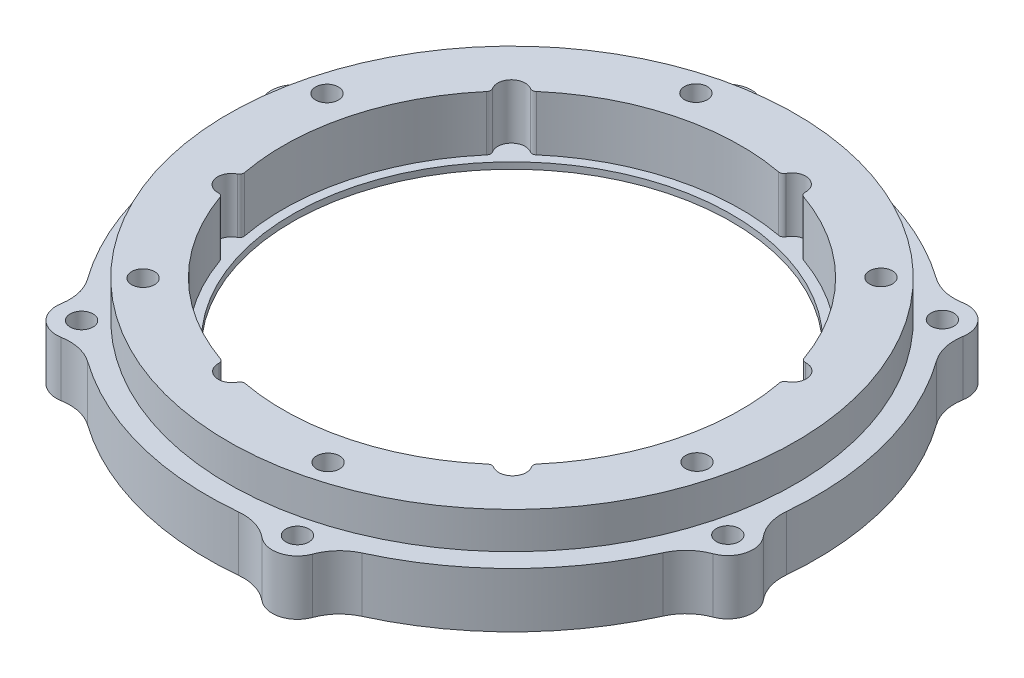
ISO-10303-21;
HEADER;
FILE_DESCRIPTION(('STEP AP214'),'2;1');
FILE_NAME('part.step','',(''),(''),'','','');
FILE_SCHEMA(('AUTOMOTIVE_DESIGN { 1 0 10303 214 1 1 1 1 }'));
ENDSEC;
DATA;
#1=APPLICATION_CONTEXT('core data for automotive mechanical design processes');
#2=APPLICATION_PROTOCOL_DEFINITION('international standard','automotive_design',2000,#1);
#3=PRODUCT_CONTEXT('',#1,'mechanical');
#4=PRODUCT('Part','Part','',(#3));
#5=PRODUCT_RELATED_PRODUCT_CATEGORY('part','',(#4));
#6=PRODUCT_DEFINITION_FORMATION('','',#4);
#7=PRODUCT_DEFINITION_CONTEXT('part definition',#1,'design');
#8=PRODUCT_DEFINITION('design','',#6,#7);
#9=PRODUCT_DEFINITION_SHAPE('','',#8);
#10=(LENGTH_UNIT() NAMED_UNIT(*) SI_UNIT(.MILLI.,.METRE.));
#11=(NAMED_UNIT(*) PLANE_ANGLE_UNIT() SI_UNIT($,.RADIAN.));
#12=(NAMED_UNIT(*) SI_UNIT($,.STERADIAN.) SOLID_ANGLE_UNIT());
#13=UNCERTAINTY_MEASURE_WITH_UNIT(LENGTH_MEASURE(1.E-05),#10,'distance_accuracy_value','');
#14=(GEOMETRIC_REPRESENTATION_CONTEXT(3) GLOBAL_UNCERTAINTY_ASSIGNED_CONTEXT((#13)) GLOBAL_UNIT_ASSIGNED_CONTEXT((#10,
#11,#12)) REPRESENTATION_CONTEXT('',''));
#15=CARTESIAN_POINT('',(0.,0.,0.));
#16=DIRECTION('',(0.,0.,1.));
#17=DIRECTION('',(1.,0.,0.));
#18=AXIS2_PLACEMENT_3D('',#15,#16,#17);
#19=CARTESIAN_POINT('',(1035.17526448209,1032.36700558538,1054.72295651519));
#20=DIRECTION('',(0.,-1.,0.));
#21=DIRECTION('',(-0.966366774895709,0.,-0.257167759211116));
#22=AXIS2_PLACEMENT_3D('',#19,#20,#21);
#23=CYLINDRICAL_SURFACE('',#22,2.75000000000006);
#24=CARTESIAN_POINT('',(1035.17526448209,1028.36700558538,1054.72295651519));
#25=DIRECTION('',(0.,1.,0.));
#26=DIRECTION('',(0.966366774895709,0.,0.257167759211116));
#27=AXIS2_PLACEMENT_3D('',#24,#25,#26);
#28=CIRCLE('',#27,2.75000000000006);
#29=CARTESIAN_POINT('',(1033.42037968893,1028.36700558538,1056.8402376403));
#30=VERTEX_POINT('',#29);
#31=CARTESIAN_POINT('',(1037.7569332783,1028.36700558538,1055.67031401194));
#32=VERTEX_POINT('',#31);
#33=EDGE_CURVE('E717',#30,#32,#28,.T.);
#34=ORIENTED_EDGE('',*,*,#33,.F.);
#35=DIRECTION('',(0.,-1.,0.));
#36=VECTOR('',#35,1.);
#37=CARTESIAN_POINT('',(1033.42037968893,1032.36700558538,1056.8402376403));
#38=LINE('',#37,#36);
#39=CARTESIAN_POINT('',(1033.42037968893,1022.36700558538,1056.8402376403));
#40=VERTEX_POINT('',#39);
#41=EDGE_CURVE('E11',#30,#40,#38,.T.);
#42=ORIENTED_EDGE('',*,*,#41,.T.);
#43=CARTESIAN_POINT('',(1035.17526448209,1022.36700558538,1054.72295651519));
#44=DIRECTION('',(0.,1.,0.));
#45=DIRECTION('',(0.966366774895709,0.,0.257167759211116));
#46=AXIS2_PLACEMENT_3D('',#43,#44,#45);
#47=CIRCLE('',#46,2.75000000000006);
#48=CARTESIAN_POINT('',(1037.7569332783,1022.36700558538,1055.67031401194));
#49=VERTEX_POINT('',#48);
#50=EDGE_CURVE('E526',#40,#49,#47,.T.);
#51=ORIENTED_EDGE('',*,*,#50,.T.);
#52=DIRECTION('',(0.,1.,0.));
#53=VECTOR('',#52,1.);
#54=CARTESIAN_POINT('',(1037.7569332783,1032.36700558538,1055.67031401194));
#55=LINE('',#54,#53);
#56=EDGE_CURVE('E641',#49,#32,#55,.T.);
#57=ORIENTED_EDGE('',*,*,#56,.T.);
#58=EDGE_LOOP('',(#34,#42,#51,#57));
#59=FACE_BOUND('',#58,.T.);
#60=ADVANCED_FACE('F17',(#59),#23,.T.);
#61=CARTESIAN_POINT('',(1026.51465111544,1032.36700558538,1022.62067815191));
#62=DIRECTION('',(0.,-1.,0.));
#63=DIRECTION('',(-0.966366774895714,0.,-0.257167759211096));
#64=AXIS2_PLACEMENT_3D('',#61,#62,#63);
#65=CYLINDRICAL_SURFACE('',#64,33.25);
#66=CARTESIAN_POINT('',(1026.51465111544,1028.36700558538,1022.62067815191));
#67=DIRECTION('',(0.,1.,0.));
#68=DIRECTION('',(0.966366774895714,0.,0.257167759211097));
#69=AXIS2_PLACEMENT_3D('',#66,#67,#68);
#70=CIRCLE('',#69,33.25);
#71=CARTESIAN_POINT('',(1040.36770982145,1028.36700558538,1052.84740911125));
#72=VERTEX_POINT('',#71);
#73=CARTESIAN_POINT('',(1056.78855919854,1028.36700558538,1036.37033230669));
#74=VERTEX_POINT('',#73);
#75=EDGE_CURVE('E899',#72,#74,#70,.T.);
#76=ORIENTED_EDGE('',*,*,#75,.F.);
#77=DIRECTION('',(0.,-1.,0.));
#78=VECTOR('',#77,1.);
#79=CARTESIAN_POINT('',(1040.36770982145,1032.36700558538,1052.84740911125));
#80=LINE('',#79,#78);
#81=CARTESIAN_POINT('',(1040.36770982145,1022.36700558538,1052.84740911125));
#82=VERTEX_POINT('',#81);
#83=EDGE_CURVE('E38',#72,#82,#80,.T.);
#84=ORIENTED_EDGE('',*,*,#83,.T.);
#85=CARTESIAN_POINT('',(1026.51465111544,1022.36700558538,1022.62067815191));
#86=DIRECTION('',(0.,1.,0.));
#87=DIRECTION('',(0.966366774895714,0.,0.257167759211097));
#88=AXIS2_PLACEMENT_3D('',#85,#86,#87);
#89=CIRCLE('',#88,33.25);
#90=CARTESIAN_POINT('',(1056.78855919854,1022.36700558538,1036.37033230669));
#91=VERTEX_POINT('',#90);
#92=EDGE_CURVE('E602',#82,#91,#89,.T.);
#93=ORIENTED_EDGE('',*,*,#92,.T.);
#94=DIRECTION('',(0.,1.,0.));
#95=VECTOR('',#94,1.);
#96=CARTESIAN_POINT('',(1056.78855919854,1032.36700558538,1036.37033230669));
#97=LINE('',#96,#95);
#98=EDGE_CURVE('E49',#91,#74,#97,.T.);
#99=ORIENTED_EDGE('',*,*,#98,.T.);
#100=EDGE_LOOP('',(#76,#84,#93,#99));
#101=FACE_BOUND('',#100,.T.);
#102=ADVANCED_FACE('F2205',(#101),#65,.T.);
#103=CARTESIAN_POINT('',(1058.64634638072,1032.36700558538,1031.17150614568));
#104=DIRECTION('',(0.,-1.,0.));
#105=DIRECTION('',(-0.966366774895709,0.,-0.257167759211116));
#106=AXIS2_PLACEMENT_3D('',#103,#104,#105);
#107=CYLINDRICAL_SURFACE('',#106,2.75000000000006);
#108=CARTESIAN_POINT('',(1058.64634638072,1028.36700558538,1031.17150614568));
#109=DIRECTION('',(0.,1.,0.));
#110=DIRECTION('',(0.966366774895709,0.,0.257167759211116));
#111=AXIS2_PLACEMENT_3D('',#108,#109,#110);
#112=CIRCLE('',#111,2.75000000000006);
#113=CARTESIAN_POINT('',(1059.60252322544,1028.36700558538,1033.74992151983));
#114=VERTEX_POINT('',#113);
#115=CARTESIAN_POINT('',(1060.75761643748,1028.36700558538,1029.40939413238));
#116=VERTEX_POINT('',#115);
#117=EDGE_CURVE('E854',#114,#116,#112,.T.);
#118=ORIENTED_EDGE('',*,*,#117,.F.);
#119=DIRECTION('',(0.,-1.,0.));
#120=VECTOR('',#119,1.);
#121=CARTESIAN_POINT('',(1059.60252322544,1032.36700558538,1033.74992151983));
#122=LINE('',#121,#120);
#123=CARTESIAN_POINT('',(1059.60252322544,1022.36700558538,1033.74992151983));
#124=VERTEX_POINT('',#123);
#125=EDGE_CURVE('E661',#114,#124,#122,.T.);
#126=ORIENTED_EDGE('',*,*,#125,.T.);
#127=CARTESIAN_POINT('',(1058.64634638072,1022.36700558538,1031.17150614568));
#128=DIRECTION('',(0.,1.,0.));
#129=DIRECTION('',(0.966366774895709,0.,0.257167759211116));
#130=AXIS2_PLACEMENT_3D('',#127,#128,#129);
#131=CIRCLE('',#130,2.75000000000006);
#132=CARTESIAN_POINT('',(1060.75761643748,1022.36700558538,1029.40939413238));
#133=VERTEX_POINT('',#132);
#134=EDGE_CURVE('E594',#124,#133,#131,.T.);
#135=ORIENTED_EDGE('',*,*,#134,.T.);
#136=DIRECTION('',(0.,1.,0.));
#137=VECTOR('',#136,1.);
#138=CARTESIAN_POINT('',(1060.75761643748,1032.36700558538,1029.40939413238));
#139=LINE('',#138,#137);
#140=EDGE_CURVE('E664',#133,#116,#139,.T.);
#141=ORIENTED_EDGE('',*,*,#140,.T.);
#142=EDGE_LOOP('',(#118,#126,#135,#141));
#143=FACE_BOUND('',#142,.T.);
#144=ADVANCED_FACE('F2210',(#143),#107,.T.);
#145=CARTESIAN_POINT('',(1026.51465111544,1032.36700558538,1022.62067815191));
#146=DIRECTION('',(0.,-1.,0.));
#147=DIRECTION('',(-0.966366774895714,0.,-0.257167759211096));
#148=AXIS2_PLACEMENT_3D('',#145,#146,#147);
#149=CYLINDRICAL_SURFACE('',#148,33.25);
#150=CARTESIAN_POINT('',(1026.51465111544,1028.36700558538,1022.62067815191));
#151=DIRECTION('',(0.,1.,0.));
#152=DIRECTION('',(0.966366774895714,0.,0.257167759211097));
#153=AXIS2_PLACEMENT_3D('',#150,#151,#152);
#154=CIRCLE('',#153,33.25);
#155=CARTESIAN_POINT('',(1059.61829735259,1028.36700558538,1025.73694287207));
#156=VERTEX_POINT('',#155);
#157=CARTESIAN_POINT('',(1053.55915494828,1028.36700558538,1003.2775317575));
#158=VERTEX_POINT('',#157);
#159=EDGE_CURVE('E931',#156,#158,#154,.T.);
#160=ORIENTED_EDGE('',*,*,#159,.F.);
#161=DIRECTION('',(0.,-1.,0.));
#162=VECTOR('',#161,1.);
#163=CARTESIAN_POINT('',(1059.61829735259,1032.36700558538,1025.73694287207));
#164=LINE('',#163,#162);
#165=CARTESIAN_POINT('',(1059.61829735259,1022.36700558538,1025.73694287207));
#166=VERTEX_POINT('',#165);
#167=EDGE_CURVE('E667',#156,#166,#164,.T.);
#168=ORIENTED_EDGE('',*,*,#167,.T.);
#169=CARTESIAN_POINT('',(1026.51465111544,1022.36700558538,1022.62067815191));
#170=DIRECTION('',(0.,1.,0.));
#171=DIRECTION('',(0.966366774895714,0.,0.257167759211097));
#172=AXIS2_PLACEMENT_3D('',#169,#170,#171);
#173=CIRCLE('',#172,33.25);
#174=CARTESIAN_POINT('',(1053.55915494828,1022.36700558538,1003.2775317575));
#175=VERTEX_POINT('',#174);
#176=EDGE_CURVE('E589',#166,#175,#173,.T.);
#177=ORIENTED_EDGE('',*,*,#176,.T.);
#178=DIRECTION('',(0.,1.,0.));
#179=VECTOR('',#178,1.);
#180=CARTESIAN_POINT('',(1053.55915494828,1032.36700558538,1003.2775317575));
#181=LINE('',#180,#179);
#182=EDGE_CURVE('E670',#175,#158,#181,.T.);
#183=ORIENTED_EDGE('',*,*,#182,.T.);
#184=EDGE_LOOP('',(#160,#168,#177,#183));
#185=FACE_BOUND('',#184,.T.);
#186=ADVANCED_FACE('F2509',(#185),#149,.T.);
#187=CARTESIAN_POINT('',(1049.98573301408,1032.36700558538,999.069227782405));
#188=DIRECTION('',(0.,-1.,0.));
#189=DIRECTION('',(-0.966366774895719,0.,-0.257167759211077));
#190=AXIS2_PLACEMENT_3D('',#187,#188,#189);
#191=CYLINDRICAL_SURFACE('',#190,2.75);
#192=CARTESIAN_POINT('',(1049.98573301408,1028.36700558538,999.069227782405));
#193=DIRECTION('',(0.,1.,0.));
#194=DIRECTION('',(0.966366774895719,0.,0.257167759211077));
#195=AXIS2_PLACEMENT_3D('',#192,#193,#194);
#196=CIRCLE('',#195,2.75);
#197=CARTESIAN_POINT('',(1052.69679465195,1028.36700558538,999.530362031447));
#198=VERTEX_POINT('',#197);
#199=CARTESIAN_POINT('',(1049.51533427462,1028.36700558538,996.35975827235));
#200=VERTEX_POINT('',#199);
#201=EDGE_CURVE('E735',#198,#200,#196,.T.);
#202=ORIENTED_EDGE('',*,*,#201,.F.);
#203=DIRECTION('',(0.,-1.,0.));
#204=VECTOR('',#203,1.);
#205=CARTESIAN_POINT('',(1052.69679465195,1032.36700558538,999.530362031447));
#206=LINE('',#205,#204);
#207=CARTESIAN_POINT('',(1052.69679465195,1022.36700558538,999.530362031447));
#208=VERTEX_POINT('',#207);
#209=EDGE_CURVE('E671',#198,#208,#206,.T.);
#210=ORIENTED_EDGE('',*,*,#209,.T.);
#211=CARTESIAN_POINT('',(1049.98573301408,1022.36700558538,999.069227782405));
#212=DIRECTION('',(0.,1.,0.));
#213=DIRECTION('',(0.966366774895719,0.,0.257167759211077));
#214=AXIS2_PLACEMENT_3D('',#211,#212,#213);
#215=CIRCLE('',#214,2.75);
#216=CARTESIAN_POINT('',(1049.51533427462,1022.36700558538,996.35975827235));
#217=VERTEX_POINT('',#216);
#218=EDGE_CURVE('E581',#208,#217,#215,.T.);
#219=ORIENTED_EDGE('',*,*,#218,.T.);
#220=DIRECTION('',(0.,1.,0.));
#221=VECTOR('',#220,1.);
#222=CARTESIAN_POINT('',(1049.51533427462,1032.36700558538,996.35975827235));
#223=LINE('',#222,#221);
#224=EDGE_CURVE('E674',#217,#200,#223,.T.);
#225=ORIENTED_EDGE('',*,*,#224,.T.);
#226=EDGE_LOOP('',(#202,#210,#219,#225));
#227=FACE_BOUND('',#226,.T.);
#228=ADVANCED_FACE('F2633',(#227),#191,.T.);
#229=CARTESIAN_POINT('',(1026.51465111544,1032.36700558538,1022.62067815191));
#230=DIRECTION('',(0.,-1.,0.));
#231=DIRECTION('',(-0.966366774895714,0.,-0.257167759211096));
#232=AXIS2_PLACEMENT_3D('',#229,#230,#231);
#233=CYLINDRICAL_SURFACE('',#232,33.25);
#234=CARTESIAN_POINT('',(1026.51465111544,1028.36700558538,1022.62067815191));
#235=DIRECTION('',(0.,1.,0.));
#236=DIRECTION('',(0.966366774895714,0.,0.257167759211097));
#237=AXIS2_PLACEMENT_3D('',#234,#235,#236);
#238=CIRCLE('',#237,33.25);
#239=CARTESIAN_POINT('',(1045.76523864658,1028.36700558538,995.510211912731));
#240=VERTEX_POINT('',#239);
#241=CARTESIAN_POINT('',(1023.28524686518,1028.36700558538,989.527877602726));
#242=VERTEX_POINT('',#241);
#243=EDGE_CURVE('E766',#240,#242,#238,.T.);
#244=ORIENTED_EDGE('',*,*,#243,.F.);
#245=DIRECTION('',(0.,-1.,0.));
#246=VECTOR('',#245,1.);
#247=CARTESIAN_POINT('',(1045.76523864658,1032.36700558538,995.510211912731));
#248=LINE('',#247,#246);
#249=CARTESIAN_POINT('',(1045.76523864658,1022.36700558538,995.510211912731));
#250=VERTEX_POINT('',#249);
#251=EDGE_CURVE('E677',#240,#250,#248,.T.);
#252=ORIENTED_EDGE('',*,*,#251,.T.);
#253=CARTESIAN_POINT('',(1026.51465111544,1022.36700558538,1022.62067815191));
#254=DIRECTION('',(0.,1.,0.));
#255=DIRECTION('',(0.966366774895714,0.,0.257167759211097));
#256=AXIS2_PLACEMENT_3D('',#253,#254,#255);
#257=CIRCLE('',#256,33.25);
#258=CARTESIAN_POINT('',(1023.28524686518,1022.36700558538,989.527877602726));
#259=VERTEX_POINT('',#258);
#260=EDGE_CURVE('E573',#250,#259,#257,.T.);
#261=ORIENTED_EDGE('',*,*,#260,.T.);
#262=DIRECTION('',(0.,1.,0.));
#263=VECTOR('',#262,1.);
#264=CARTESIAN_POINT('',(1023.28524686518,1032.36700558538,989.527877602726));
#265=LINE('',#264,#263);
#266=EDGE_CURVE('E642',#259,#242,#265,.T.);
#267=ORIENTED_EDGE('',*,*,#266,.T.);
#268=EDGE_LOOP('',(#244,#252,#261,#267));
#269=FACE_BOUND('',#268,.T.);
#270=ADVANCED_FACE('F2627',(#269),#233,.T.);
#271=CARTESIAN_POINT('',(1017.8540377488,1032.36700558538,990.518399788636));
#272=DIRECTION('',(0.,-1.,0.));
#273=DIRECTION('',(-0.966366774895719,0.,-0.257167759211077));
#274=AXIS2_PLACEMENT_3D('',#271,#272,#273);
#275=CYLINDRICAL_SURFACE('',#274,2.75);
#276=CARTESIAN_POINT('',(1017.8540377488,1028.36700558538,990.518399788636));
#277=DIRECTION('',(0.,1.,0.));
#278=DIRECTION('',(0.966366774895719,0.,0.257167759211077));
#279=AXIS2_PLACEMENT_3D('',#276,#277,#278);
#280=CIRCLE('',#279,2.75);
#281=CARTESIAN_POINT('',(1019.60892254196,1028.36700558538,988.401118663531));
#282=VERTEX_POINT('',#281);
#283=CARTESIAN_POINT('',(1015.27236895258,1028.36700558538,989.57104229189));
#284=VERTEX_POINT('',#283);
#285=EDGE_CURVE('E765',#282,#284,#280,.T.);
#286=ORIENTED_EDGE('',*,*,#285,.F.);
#287=DIRECTION('',(0.,-1.,0.));
#288=VECTOR('',#287,1.);
#289=CARTESIAN_POINT('',(1019.60892254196,1032.36700558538,988.401118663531));
#290=LINE('',#289,#288);
#291=CARTESIAN_POINT('',(1019.60892254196,1022.36700558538,988.401118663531));
#292=VERTEX_POINT('',#291);
#293=EDGE_CURVE('E638',#282,#292,#290,.T.);
#294=ORIENTED_EDGE('',*,*,#293,.T.);
#295=CARTESIAN_POINT('',(1017.8540377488,1022.36700558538,990.518399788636));
#296=DIRECTION('',(0.,1.,0.));
#297=DIRECTION('',(0.966366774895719,0.,0.257167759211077));
#298=AXIS2_PLACEMENT_3D('',#295,#296,#297);
#299=CIRCLE('',#298,2.75);
#300=CARTESIAN_POINT('',(1015.27236895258,1022.36700558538,989.57104229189));
#301=VERTEX_POINT('',#300);
#302=EDGE_CURVE('E568',#292,#301,#299,.T.);
#303=ORIENTED_EDGE('',*,*,#302,.T.);
#304=DIRECTION('',(0.,1.,0.));
#305=VECTOR('',#304,1.);
#306=CARTESIAN_POINT('',(1015.27236895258,1032.36700558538,989.57104229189));
#307=LINE('',#306,#305);
#308=EDGE_CURVE('E637',#301,#284,#307,.T.);
#309=ORIENTED_EDGE('',*,*,#308,.T.);
#310=EDGE_LOOP('',(#286,#294,#303,#309));
#311=FACE_BOUND('',#310,.T.);
#312=ADVANCED_FACE('F2632',(#311),#275,.T.);
#313=CARTESIAN_POINT('',(1026.51465111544,1032.36700558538,1022.62067815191));
#314=DIRECTION('',(0.,-1.,0.));
#315=DIRECTION('',(-0.966366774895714,0.,-0.257167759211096));
#316=AXIS2_PLACEMENT_3D('',#313,#314,#315);
#317=CYLINDRICAL_SURFACE('',#316,33.25);
#318=CARTESIAN_POINT('',(1026.51465111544,1028.36700558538,1022.62067815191));
#319=DIRECTION('',(0.,1.,0.));
#320=DIRECTION('',(0.966366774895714,0.,0.257167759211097));
#321=AXIS2_PLACEMENT_3D('',#318,#319,#320);
#322=CIRCLE('',#321,33.25);
#323=CARTESIAN_POINT('',(1012.66159240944,1028.36700558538,992.39394719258));
#324=VERTEX_POINT('',#323);
#325=CARTESIAN_POINT('',(996.240743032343,1028.36700558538,1008.87102399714));
#326=VERTEX_POINT('',#325);
#327=EDGE_CURVE('E955',#324,#326,#322,.T.);
#328=ORIENTED_EDGE('',*,*,#327,.F.);
#329=DIRECTION('',(0.,-1.,0.));
#330=VECTOR('',#329,1.);
#331=CARTESIAN_POINT('',(1012.66159240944,1032.36700558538,992.39394719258));
#332=LINE('',#331,#330);
#333=CARTESIAN_POINT('',(1012.66159240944,1022.36700558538,992.39394719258));
#334=VERTEX_POINT('',#333);
#335=EDGE_CURVE('E645',#324,#334,#332,.T.);
#336=ORIENTED_EDGE('',*,*,#335,.T.);
#337=CARTESIAN_POINT('',(1026.51465111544,1022.36700558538,1022.62067815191));
#338=DIRECTION('',(0.,1.,0.));
#339=DIRECTION('',(0.966366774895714,0.,0.257167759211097));
#340=AXIS2_PLACEMENT_3D('',#337,#338,#339);
#341=CIRCLE('',#340,33.25);
#342=CARTESIAN_POINT('',(996.240743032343,1022.36700558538,1008.87102399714));
#343=VERTEX_POINT('',#342);
#344=EDGE_CURVE('E559',#334,#343,#341,.T.);
#345=ORIENTED_EDGE('',*,*,#344,.T.);
#346=DIRECTION('',(0.,1.,0.));
#347=VECTOR('',#346,1.);
#348=CARTESIAN_POINT('',(996.240743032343,1032.36700558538,1008.87102399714));
#349=LINE('',#348,#347);
#350=EDGE_CURVE('E680',#343,#326,#349,.T.);
#351=ORIENTED_EDGE('',*,*,#350,.T.);
#352=EDGE_LOOP('',(#328,#336,#345,#351));
#353=FACE_BOUND('',#352,.T.);
#354=ADVANCED_FACE('F2781',(#353),#317,.T.);
#355=CARTESIAN_POINT('',(994.38295585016,1032.36700558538,1014.06985015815));
#356=DIRECTION('',(0.,-1.,0.));
#357=DIRECTION('',(-0.966366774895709,0.,-0.257167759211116));
#358=AXIS2_PLACEMENT_3D('',#355,#356,#357);
#359=CYLINDRICAL_SURFACE('',#358,2.75000000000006);
#360=DIRECTION('',(0.,-1.,0.));
#361=VECTOR('',#360,1.);
#362=CARTESIAN_POINT('',(993.426779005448,1032.36700558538,1011.491434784));
#363=LINE('',#362,#361);
#364=CARTESIAN_POINT('',(993.426779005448,1028.36700558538,1011.491434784));
#365=VERTEX_POINT('',#364);
#366=CARTESIAN_POINT('',(993.426779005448,1022.36700558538,1011.491434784));
#367=VERTEX_POINT('',#366);
#368=EDGE_CURVE('E683',#365,#367,#363,.T.);
#369=ORIENTED_EDGE('',*,*,#368,.T.);
#370=CARTESIAN_POINT('',(994.38295585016,1022.36700558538,1014.06985015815));
#371=DIRECTION('',(0.,1.,0.));
#372=DIRECTION('',(0.966366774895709,0.,0.257167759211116));
#373=AXIS2_PLACEMENT_3D('',#370,#371,#372);
#374=CIRCLE('',#373,2.75000000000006);
#375=CARTESIAN_POINT('',(992.271685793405,1022.36700558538,1015.83196217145));
#376=VERTEX_POINT('',#375);
#377=EDGE_CURVE('E560',#367,#376,#374,.T.);
#378=ORIENTED_EDGE('',*,*,#377,.T.);
#379=DIRECTION('',(0.,1.,0.));
#380=VECTOR('',#379,1.);
#381=CARTESIAN_POINT('',(992.271685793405,1032.36700558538,1015.83196217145));
#382=LINE('',#381,#380);
#383=CARTESIAN_POINT('',(992.271685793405,1028.36700558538,1015.83196217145));
#384=VERTEX_POINT('',#383);
#385=EDGE_CURVE('E684',#376,#384,#382,.T.);
#386=ORIENTED_EDGE('',*,*,#385,.T.);
#387=CARTESIAN_POINT('',(994.38295585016,1028.36700558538,1014.06985015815));
#388=DIRECTION('',(0.,1.,0.));
#389=DIRECTION('',(0.966366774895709,0.,0.257167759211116));
#390=AXIS2_PLACEMENT_3D('',#387,#388,#389);
#391=CIRCLE('',#390,2.75000000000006);
#392=EDGE_CURVE('E831',#365,#384,#391,.T.);
#393=ORIENTED_EDGE('',*,*,#392,.F.);
#394=EDGE_LOOP('',(#369,#378,#386,#393));
#395=FACE_BOUND('',#394,.T.);
#396=ADVANCED_FACE('F2770',(#395),#359,.T.);
#397=CARTESIAN_POINT('',(1026.51465111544,1032.36700558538,1022.62067815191));
#398=DIRECTION('',(0.,-1.,0.));
#399=DIRECTION('',(-0.966366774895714,0.,-0.257167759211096));
#400=AXIS2_PLACEMENT_3D('',#397,#398,#399);
#401=CYLINDRICAL_SURFACE('',#400,33.25);
#402=CARTESIAN_POINT('',(1026.51465111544,1028.36700558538,1022.62067815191));
#403=DIRECTION('',(0.,1.,0.));
#404=DIRECTION('',(0.966366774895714,0.,0.257167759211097));
#405=AXIS2_PLACEMENT_3D('',#402,#403,#404);
#406=CIRCLE('',#405,33.25);
#407=CARTESIAN_POINT('',(993.4110048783,1028.36700558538,1019.50441343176));
#408=VERTEX_POINT('',#407);
#409=CARTESIAN_POINT('',(999.470147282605,1028.36700558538,1041.96382454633));
#410=VERTEX_POINT('',#409);
#411=EDGE_CURVE('E830',#408,#410,#406,.T.);
#412=ORIENTED_EDGE('',*,*,#411,.F.);
#413=DIRECTION('',(0.,-1.,0.));
#414=VECTOR('',#413,1.);
#415=CARTESIAN_POINT('',(993.4110048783,1032.36700558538,1019.50441343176));
#416=LINE('',#415,#414);
#417=CARTESIAN_POINT('',(993.4110048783,1022.36700558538,1019.50441343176));
#418=VERTEX_POINT('',#417);
#419=EDGE_CURVE('E654',#408,#418,#416,.T.);
#420=ORIENTED_EDGE('',*,*,#419,.T.);
#421=CARTESIAN_POINT('',(1026.51465111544,1022.36700558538,1022.62067815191));
#422=DIRECTION('',(0.,1.,0.));
#423=DIRECTION('',(0.966366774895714,0.,0.257167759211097));
#424=AXIS2_PLACEMENT_3D('',#421,#422,#423);
#425=CIRCLE('',#424,33.25);
#426=CARTESIAN_POINT('',(999.470147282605,1022.36700558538,1041.96382454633));
#427=VERTEX_POINT('',#426);
#428=EDGE_CURVE('E550',#418,#427,#425,.T.);
#429=ORIENTED_EDGE('',*,*,#428,.T.);
#430=DIRECTION('',(0.,1.,0.));
#431=VECTOR('',#430,1.);
#432=CARTESIAN_POINT('',(999.470147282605,1032.36700558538,1041.96382454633));
#433=LINE('',#432,#431);
#434=EDGE_CURVE('E650',#427,#410,#433,.T.);
#435=ORIENTED_EDGE('',*,*,#434,.T.);
#436=EDGE_LOOP('',(#412,#420,#429,#435));
#437=FACE_BOUND('',#436,.T.);
#438=ADVANCED_FACE('F2759',(#437),#401,.T.);
#439=CARTESIAN_POINT('',(1003.04356921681,1032.36700558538,1046.17212852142));
#440=DIRECTION('',(0.,-1.,0.));
#441=DIRECTION('',(-0.966366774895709,0.,-0.257167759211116));
#442=AXIS2_PLACEMENT_3D('',#439,#440,#441);
#443=CYLINDRICAL_SURFACE('',#442,2.75000000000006);
#444=CARTESIAN_POINT('',(1003.04356921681,1028.36700558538,1046.17212852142));
#445=DIRECTION('',(0.,1.,0.));
#446=DIRECTION('',(0.966366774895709,0.,0.257167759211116));
#447=AXIS2_PLACEMENT_3D('',#444,#445,#446);
#448=CIRCLE('',#447,2.75000000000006);
#449=CARTESIAN_POINT('',(1000.33250757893,1028.36700558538,1045.71099427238));
#450=VERTEX_POINT('',#449);
#451=CARTESIAN_POINT('',(1003.51396795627,1028.36700558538,1048.88159803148));
#452=VERTEX_POINT('',#451);
#453=EDGE_CURVE('E729',#450,#452,#448,.T.);
#454=ORIENTED_EDGE('',*,*,#453,.F.);
#455=DIRECTION('',(0.,-1.,0.));
#456=VECTOR('',#455,1.);
#457=CARTESIAN_POINT('',(1000.33250757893,1032.36700558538,1045.71099427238));
#458=LINE('',#457,#456);
#459=CARTESIAN_POINT('',(1000.33250757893,1022.36700558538,1045.71099427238));
#460=VERTEX_POINT('',#459);
#461=EDGE_CURVE('E653',#450,#460,#458,.T.);
#462=ORIENTED_EDGE('',*,*,#461,.T.);
#463=CARTESIAN_POINT('',(1003.04356921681,1022.36700558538,1046.17212852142));
#464=DIRECTION('',(0.,1.,0.));
#465=DIRECTION('',(0.966366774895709,0.,0.257167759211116));
#466=AXIS2_PLACEMENT_3D('',#463,#464,#465);
#467=CIRCLE('',#466,2.75000000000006);
#468=CARTESIAN_POINT('',(1003.51396795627,1022.36700558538,1048.88159803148));
#469=VERTEX_POINT('',#468);
#470=EDGE_CURVE('E542',#460,#469,#467,.T.);
#471=ORIENTED_EDGE('',*,*,#470,.T.);
#472=DIRECTION('',(0.,1.,0.));
#473=VECTOR('',#472,1.);
#474=CARTESIAN_POINT('',(1003.51396795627,1032.36700558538,1048.88159803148));
#475=LINE('',#474,#473);
#476=EDGE_CURVE('E692',#469,#452,#475,.T.);
#477=ORIENTED_EDGE('',*,*,#476,.T.);
#478=EDGE_LOOP('',(#454,#462,#471,#477));
#479=FACE_BOUND('',#478,.T.);
#480=ADVANCED_FACE('F2748',(#479),#443,.T.);
#481=CARTESIAN_POINT('',(994.38295585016,1032.36700558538,1014.06985015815));
#482=DIRECTION('',(0.,-1.,0.));
#483=DIRECTION('',(-0.966366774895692,0.,-0.257167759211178));
#484=AXIS2_PLACEMENT_3D('',#481,#482,#483);
#485=CYLINDRICAL_SURFACE('',#484,1.25000000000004);
#486=CARTESIAN_POINT('',(994.38295585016,1022.36700558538,1014.06985015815));
#487=DIRECTION('',(0.,1.,0.));
#488=DIRECTION('',(0.966366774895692,0.,0.257167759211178));
#489=AXIS2_PLACEMENT_3D('',#486,#487,#488);
#490=CIRCLE('',#489,1.25000000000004);
#491=CARTESIAN_POINT('',(995.59091431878,1022.36700558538,1014.39130985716));
#492=VERTEX_POINT('',#491);
#493=EDGE_CURVE('E613',#492,#492,#490,.T.);
#494=ORIENTED_EDGE('',*,*,#493,.F.);
#495=EDGE_LOOP('',(#494));
#496=FACE_BOUND('',#495,.T.);
#497=CARTESIAN_POINT('',(994.38295585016,1028.36700558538,1014.06985015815));
#498=DIRECTION('',(0.,1.,0.));
#499=DIRECTION('',(0.966366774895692,0.,0.257167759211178));
#500=AXIS2_PLACEMENT_3D('',#497,#498,#499);
#501=CIRCLE('',#500,1.25000000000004);
#502=CARTESIAN_POINT('',(995.59091431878,1028.36700558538,1014.39130985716));
#503=VERTEX_POINT('',#502);
#504=EDGE_CURVE('E867',#503,#503,#501,.T.);
#505=ORIENTED_EDGE('',*,*,#504,.T.);
#506=EDGE_LOOP('',(#505));
#507=FACE_BOUND('',#506,.T.);
#508=ADVANCED_FACE('F2737',(#496,#507),#485,.F.);
#509=CARTESIAN_POINT('',(1003.04356921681,1032.36700558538,1046.17212852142));
#510=DIRECTION('',(0.,-1.,0.));
#511=DIRECTION('',(-0.966366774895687,0.,-0.257167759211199));
#512=AXIS2_PLACEMENT_3D('',#509,#510,#511);
#513=CYLINDRICAL_SURFACE('',#512,1.24999999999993);
#514=CARTESIAN_POINT('',(1003.04356921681,1022.36700558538,1046.17212852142));
#515=DIRECTION('',(0.,1.,0.));
#516=DIRECTION('',(0.966366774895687,0.,0.257167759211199));
#517=AXIS2_PLACEMENT_3D('',#514,#515,#516);
#518=CIRCLE('',#517,1.24999999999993);
#519=CARTESIAN_POINT('',(1004.25152768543,1022.36700558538,1046.49358822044));
#520=VERTEX_POINT('',#519);
#521=EDGE_CURVE('E617',#520,#520,#518,.T.);
#522=ORIENTED_EDGE('',*,*,#521,.F.);
#523=EDGE_LOOP('',(#522));
#524=FACE_BOUND('',#523,.T.);
#525=CARTESIAN_POINT('',(1003.04356921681,1028.36700558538,1046.17212852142));
#526=DIRECTION('',(0.,1.,0.));
#527=DIRECTION('',(0.966366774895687,0.,0.257167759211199));
#528=AXIS2_PLACEMENT_3D('',#525,#526,#527);
#529=CIRCLE('',#528,1.24999999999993);
#530=CARTESIAN_POINT('',(1004.25152768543,1028.36700558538,1046.49358822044));
#531=VERTEX_POINT('',#530);
#532=EDGE_CURVE('E791',#531,#531,#529,.T.);
#533=ORIENTED_EDGE('',*,*,#532,.T.);
#534=EDGE_LOOP('',(#533));
#535=FACE_BOUND('',#534,.T.);
#536=ADVANCED_FACE('F2726',(#524,#535),#513,.F.);
#537=CARTESIAN_POINT('',(1017.8540377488,1032.36700558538,990.518399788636));
#538=DIRECTION('',(0.,-1.,0.));
#539=DIRECTION('',(-0.966366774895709,0.,-0.257167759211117));
#540=AXIS2_PLACEMENT_3D('',#537,#538,#539);
#541=CYLINDRICAL_SURFACE('',#540,1.2499999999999);
#542=CARTESIAN_POINT('',(1017.8540377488,1022.36700558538,990.518399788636));
#543=DIRECTION('',(0.,1.,0.));
#544=DIRECTION('',(0.966366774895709,0.,0.257167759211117));
#545=AXIS2_PLACEMENT_3D('',#542,#543,#544);
#546=CIRCLE('',#545,1.2499999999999);
#547=CARTESIAN_POINT('',(1019.06199621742,1022.36700558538,990.83985948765));
#548=VERTEX_POINT('',#547);
#549=EDGE_CURVE('E621',#548,#548,#546,.T.);
#550=ORIENTED_EDGE('',*,*,#549,.F.);
#551=EDGE_LOOP('',(#550));
#552=FACE_BOUND('',#551,.T.);
#553=CARTESIAN_POINT('',(1017.8540377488,1028.36700558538,990.518399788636));
#554=DIRECTION('',(0.,1.,0.));
#555=DIRECTION('',(0.966366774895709,0.,0.257167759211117));
#556=AXIS2_PLACEMENT_3D('',#553,#554,#555);
#557=CIRCLE('',#556,1.2499999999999);
#558=CARTESIAN_POINT('',(1019.06199621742,1028.36700558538,990.83985948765));
#559=VERTEX_POINT('',#558);
#560=EDGE_CURVE('E787',#559,#559,#557,.T.);
#561=ORIENTED_EDGE('',*,*,#560,.T.);
#562=EDGE_LOOP('',(#561));
#563=FACE_BOUND('',#562,.T.);
#564=ADVANCED_FACE('F2715',(#552,#563),#541,.F.);
#565=CARTESIAN_POINT('',(1049.98573301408,1032.36700558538,999.069227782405));
#566=DIRECTION('',(0.,-1.,0.));
#567=DIRECTION('',(-0.966366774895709,0.,-0.257167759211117));
#568=AXIS2_PLACEMENT_3D('',#565,#566,#567);
#569=CYLINDRICAL_SURFACE('',#568,1.2499999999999);
#570=CARTESIAN_POINT('',(1049.98573301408,1022.36700558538,999.069227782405));
#571=DIRECTION('',(0.,1.,0.));
#572=DIRECTION('',(0.966366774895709,0.,0.257167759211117));
#573=AXIS2_PLACEMENT_3D('',#570,#571,#572);
#574=CIRCLE('',#573,1.2499999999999);
#575=CARTESIAN_POINT('',(1051.1936914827,1022.36700558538,999.390687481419));
#576=VERTEX_POINT('',#575);
#577=EDGE_CURVE('E625',#576,#576,#574,.T.);
#578=ORIENTED_EDGE('',*,*,#577,.F.);
#579=EDGE_LOOP('',(#578));
#580=FACE_BOUND('',#579,.T.);
#581=CARTESIAN_POINT('',(1049.98573301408,1028.36700558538,999.069227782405));
#582=DIRECTION('',(0.,1.,0.));
#583=DIRECTION('',(0.966366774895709,0.,0.257167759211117));
#584=AXIS2_PLACEMENT_3D('',#581,#582,#583);
#585=CIRCLE('',#584,1.2499999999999);
#586=CARTESIAN_POINT('',(1051.1936914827,1028.36700558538,999.390687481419));
#587=VERTEX_POINT('',#586);
#588=EDGE_CURVE('E792',#587,#587,#585,.T.);
#589=ORIENTED_EDGE('',*,*,#588,.T.);
#590=EDGE_LOOP('',(#589));
#591=FACE_BOUND('',#590,.T.);
#592=ADVANCED_FACE('F2704',(#580,#591),#569,.F.);
#593=CARTESIAN_POINT('',(1058.64634638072,1032.36700558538,1031.17150614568));
#594=DIRECTION('',(0.,-1.,0.));
#595=DIRECTION('',(-0.966366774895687,0.,-0.257167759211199));
#596=AXIS2_PLACEMENT_3D('',#593,#594,#595);
#597=CYLINDRICAL_SURFACE('',#596,1.24999999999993);
#598=CARTESIAN_POINT('',(1058.64634638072,1022.36700558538,1031.17150614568));
#599=DIRECTION('',(0.,1.,0.));
#600=DIRECTION('',(0.966366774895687,0.,0.257167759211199));
#601=AXIS2_PLACEMENT_3D('',#598,#599,#600);
#602=CIRCLE('',#601,1.24999999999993);
#603=CARTESIAN_POINT('',(1059.85430484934,1022.36700558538,1031.4929658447));
#604=VERTEX_POINT('',#603);
#605=EDGE_CURVE('E629',#604,#604,#602,.T.);
#606=ORIENTED_EDGE('',*,*,#605,.F.);
#607=EDGE_LOOP('',(#606));
#608=FACE_BOUND('',#607,.T.);
#609=CARTESIAN_POINT('',(1058.64634638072,1028.36700558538,1031.17150614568));
#610=DIRECTION('',(0.,1.,0.));
#611=DIRECTION('',(0.966366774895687,0.,0.257167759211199));
#612=AXIS2_PLACEMENT_3D('',#609,#610,#611);
#613=CIRCLE('',#612,1.24999999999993);
#614=CARTESIAN_POINT('',(1059.85430484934,1028.36700558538,1031.4929658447));
#615=VERTEX_POINT('',#614);
#616=EDGE_CURVE('E872',#615,#615,#613,.T.);
#617=ORIENTED_EDGE('',*,*,#616,.T.);
#618=EDGE_LOOP('',(#617));
#619=FACE_BOUND('',#618,.T.);
#620=ADVANCED_FACE('F2693',(#608,#619),#597,.F.);
#621=CARTESIAN_POINT('',(1035.17526448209,1032.36700558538,1054.72295651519));
#622=DIRECTION('',(0.,-1.,0.));
#623=DIRECTION('',(-0.966366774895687,0.,-0.257167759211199));
#624=AXIS2_PLACEMENT_3D('',#621,#622,#623);
#625=CYLINDRICAL_SURFACE('',#624,1.24999999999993);
#626=CARTESIAN_POINT('',(1035.17526448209,1022.36700558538,1054.72295651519));
#627=DIRECTION('',(0.,1.,0.));
#628=DIRECTION('',(0.966366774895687,0.,0.257167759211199));
#629=AXIS2_PLACEMENT_3D('',#626,#627,#628);
#630=CIRCLE('',#629,1.24999999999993);
#631=CARTESIAN_POINT('',(1036.38322295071,1022.36700558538,1055.04441621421));
#632=VERTEX_POINT('',#631);
#633=EDGE_CURVE('E633',#632,#632,#630,.T.);
#634=ORIENTED_EDGE('',*,*,#633,.F.);
#635=EDGE_LOOP('',(#634));
#636=FACE_BOUND('',#635,.T.);
#637=CARTESIAN_POINT('',(1035.17526448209,1028.36700558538,1054.72295651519));
#638=DIRECTION('',(0.,1.,0.));
#639=DIRECTION('',(0.966366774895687,0.,0.257167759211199));
#640=AXIS2_PLACEMENT_3D('',#637,#638,#639);
#641=CIRCLE('',#640,1.24999999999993);
#642=CARTESIAN_POINT('',(1036.38322295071,1028.36700558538,1055.04441621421));
#643=VERTEX_POINT('',#642);
#644=EDGE_CURVE('E822',#643,#643,#641,.T.);
#645=ORIENTED_EDGE('',*,*,#644,.T.);
#646=EDGE_LOOP('',(#645));
#647=FACE_BOUND('',#646,.T.);
#648=ADVANCED_FACE('F2683',(#636,#647),#625,.F.);
#649=CARTESIAN_POINT('',(1026.51465111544,1032.36700558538,1022.62067815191));
#650=DIRECTION('',(0.,-1.,0.));
#651=DIRECTION('',(-0.966366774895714,0.,-0.257167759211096));
#652=AXIS2_PLACEMENT_3D('',#649,#650,#651);
#653=CYLINDRICAL_SURFACE('',#652,33.25);
#654=CARTESIAN_POINT('',(1026.51465111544,1028.36700558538,1022.62067815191));
#655=DIRECTION('',(0.,1.,0.));
#656=DIRECTION('',(0.966366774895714,0.,0.257167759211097));
#657=AXIS2_PLACEMENT_3D('',#654,#655,#656);
#658=CIRCLE('',#657,33.25);
#659=CARTESIAN_POINT('',(1007.2640635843,1028.36700558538,1049.7311443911));
#660=VERTEX_POINT('',#659);
#661=CARTESIAN_POINT('',(1029.7440553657,1028.36700558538,1055.7134787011));
#662=VERTEX_POINT('',#661);
#663=EDGE_CURVE('E705',#660,#662,#658,.T.);
#664=ORIENTED_EDGE('',*,*,#663,.F.);
#665=DIRECTION('',(0.,-1.,0.));
#666=VECTOR('',#665,1.);
#667=CARTESIAN_POINT('',(1007.2640635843,1032.36700558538,1049.7311443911));
#668=LINE('',#667,#666);
#669=CARTESIAN_POINT('',(1007.2640635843,1022.36700558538,1049.7311443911));
#670=VERTEX_POINT('',#669);
#671=EDGE_CURVE('E695',#660,#670,#668,.T.);
#672=ORIENTED_EDGE('',*,*,#671,.T.);
#673=CARTESIAN_POINT('',(1026.51465111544,1022.36700558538,1022.62067815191));
#674=DIRECTION('',(0.,1.,0.));
#675=DIRECTION('',(0.966366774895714,0.,0.257167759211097));
#676=AXIS2_PLACEMENT_3D('',#673,#674,#675);
#677=CIRCLE('',#676,33.25);
#678=CARTESIAN_POINT('',(1029.7440553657,1022.36700558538,1055.7134787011));
#679=VERTEX_POINT('',#678);
#680=EDGE_CURVE('E534',#670,#679,#677,.T.);
#681=ORIENTED_EDGE('',*,*,#680,.T.);
#682=DIRECTION('',(0.,1.,0.));
#683=VECTOR('',#682,1.);
#684=CARTESIAN_POINT('',(1029.7440553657,1032.36700558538,1055.7134787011));
#685=LINE('',#684,#683);
#686=EDGE_CURVE('E25',#679,#662,#685,.T.);
#687=ORIENTED_EDGE('',*,*,#686,.T.);
#688=EDGE_LOOP('',(#664,#672,#681,#687));
#689=FACE_BOUND('',#688,.T.);
#690=ADVANCED_FACE('F703',(#689),#653,.T.);
#691=CARTESIAN_POINT('',(1026.51465111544,1032.36700558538,1022.62067815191));
#692=DIRECTION('',(0.,1.,0.));
#693=DIRECTION('',(1.,0.,0.));
#694=AXIS2_PLACEMENT_3D('',#691,#692,#693);
#695=PLANE('',#694);
#696=CARTESIAN_POINT('',(1033.93803400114,1032.36700558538,1050.13691674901));
#697=DIRECTION('',(0.,1.,0.));
#698=DIRECTION('',(0.966366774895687,0.,0.257167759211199));
#699=AXIS2_PLACEMENT_3D('',#696,#697,#698);
#700=CIRCLE('',#699,1.24999999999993);
#701=CARTESIAN_POINT('',(1035.14599246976,1032.36700558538,1050.45837644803));
#702=VERTEX_POINT('',#701);
#703=EDGE_CURVE('E863',#702,#702,#700,.T.);
#704=ORIENTED_EDGE('',*,*,#703,.F.);
#705=EDGE_LOOP('',(#704));
#706=FACE_BOUND('',#705,.T.);
#707=CARTESIAN_POINT('',(1054.05610419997,1032.36700558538,1029.94995928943));
#708=DIRECTION('',(0.,1.,0.));
#709=DIRECTION('',(0.966366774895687,0.,0.257167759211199));
#710=AXIS2_PLACEMENT_3D('',#707,#708,#709);
#711=CIRCLE('',#710,1.24999999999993);
#712=CARTESIAN_POINT('',(1055.26406266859,1032.36700558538,1030.27141898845));
#713=VERTEX_POINT('',#712);
#714=EDGE_CURVE('E883',#713,#713,#711,.T.);
#715=ORIENTED_EDGE('',*,*,#714,.F.);
#716=EDGE_LOOP('',(#715));
#717=FACE_BOUND('',#716,.T.);
#718=CARTESIAN_POINT('',(1046.63272131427,1032.36700558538,1002.43372069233));
#719=DIRECTION('',(0.,1.,0.));
#720=DIRECTION('',(0.966366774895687,0.,0.257167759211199));
#721=AXIS2_PLACEMENT_3D('',#718,#719,#720);
#722=CIRCLE('',#721,1.24999999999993);
#723=CARTESIAN_POINT('',(1047.84067978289,1032.36700558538,1002.75518039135));
#724=VERTEX_POINT('',#723);
#725=EDGE_CURVE('E879',#724,#724,#722,.T.);
#726=ORIENTED_EDGE('',*,*,#725,.F.);
#727=EDGE_LOOP('',(#726));
#728=FACE_BOUND('',#727,.T.);
#729=CARTESIAN_POINT('',(1019.09126822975,1032.36700558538,995.104439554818));
#730=DIRECTION('',(0.,1.,0.));
#731=DIRECTION('',(0.966366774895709,0.,0.257167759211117));
#732=AXIS2_PLACEMENT_3D('',#729,#730,#731);
#733=CIRCLE('',#732,1.2499999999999);
#734=CARTESIAN_POINT('',(1020.29922669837,1032.36700558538,995.425899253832));
#735=VERTEX_POINT('',#734);
#736=EDGE_CURVE('E777',#735,#735,#733,.T.);
#737=ORIENTED_EDGE('',*,*,#736,.F.);
#738=EDGE_LOOP('',(#737));
#739=FACE_BOUND('',#738,.T.);
#740=CARTESIAN_POINT('',(998.973198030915,1032.36700558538,1015.2913970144));
#741=DIRECTION('',(0.,1.,0.));
#742=DIRECTION('',(0.966366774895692,0.,0.257167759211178));
#743=AXIS2_PLACEMENT_3D('',#740,#741,#742);
#744=CIRCLE('',#743,1.25000000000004);
#745=CARTESIAN_POINT('',(1000.18115649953,1032.36700558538,1015.61285671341));
#746=VERTEX_POINT('',#745);
#747=EDGE_CURVE('E772',#746,#746,#744,.T.);
#748=ORIENTED_EDGE('',*,*,#747,.F.);
#749=EDGE_LOOP('',(#748));
#750=FACE_BOUND('',#749,.T.);
#751=CARTESIAN_POINT('',(1006.39658091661,1032.36700558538,1042.80763561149));
#752=DIRECTION('',(0.,1.,0.));
#753=DIRECTION('',(0.966366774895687,0.,0.257167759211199));
#754=AXIS2_PLACEMENT_3D('',#751,#752,#753);
#755=CIRCLE('',#754,1.24999999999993);
#756=CARTESIAN_POINT('',(1007.60453938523,1032.36700558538,1043.12909531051));
#757=VERTEX_POINT('',#756);
#758=EDGE_CURVE('E776',#757,#757,#755,.T.);
#759=ORIENTED_EDGE('',*,*,#758,.F.);
#760=EDGE_LOOP('',(#759));
#761=FACE_BOUND('',#760,.T.);
#762=CARTESIAN_POINT('',(1026.51465111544,1032.36700558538,1022.62067815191));
#763=DIRECTION('',(0.,1.,0.));
#764=DIRECTION('',(0.966366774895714,0.,0.257167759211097));
#765=AXIS2_PLACEMENT_3D('',#762,#763,#764);
#766=CIRCLE('',#765,25.);
#767=CARTESIAN_POINT('',(1045.5229271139,1032.36700558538,1038.859072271));
#768=VERTEX_POINT('',#767);
#769=CARTESIAN_POINT('',(1051.07977143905,1032.36700558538,1017.9779565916));
#770=VERTEX_POINT('',#769);
#771=EDGE_CURVE('E520',#768,#770,#766,.T.);
#772=ORIENTED_EDGE('',*,*,#771,.F.);
#773=CARTESIAN_POINT('',(1045.90309263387,1032.36700558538,1039.18384015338));
#774=DIRECTION('',(0.,1.,0.));
#775=DIRECTION('',(0.966366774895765,0.,0.257167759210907));
#776=AXIS2_PLACEMENT_3D('',#773,#774,#775);
#777=CIRCLE('',#776,0.500000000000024);
#778=CARTESIAN_POINT('',(1045.48294660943,1032.36700558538,1039.45490715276));
#779=VERTEX_POINT('',#778);
#780=EDGE_CURVE('E484',#768,#779,#777,.T.);
#781=ORIENTED_EDGE('',*,*,#780,.T.);
#782=CARTESIAN_POINT('',(1044.22250853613,1032.36700558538,1040.26810815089));
#783=DIRECTION('',(0.,1.,0.));
#784=DIRECTION('',(0.966366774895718,0.,0.257167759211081));
#785=AXIS2_PLACEMENT_3D('',#782,#783,#784);
#786=CIRCLE('',#785,1.49999999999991);
#787=CARTESIAN_POINT('',(1043.41362082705,1032.36700558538,1041.531318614));
#788=VERTEX_POINT('',#787);
#789=EDGE_CURVE('E523',#788,#779,#786,.T.);
#790=ORIENTED_EDGE('',*,*,#789,.F.);
#791=CARTESIAN_POINT('',(1043.14399159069,1032.36700558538,1041.95238876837));
#792=DIRECTION('',(0.,1.,0.));
#793=DIRECTION('',(0.966366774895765,0.,0.257167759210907));
#794=AXIS2_PLACEMENT_3D('',#791,#792,#793);
#795=CIRCLE('',#794,0.500000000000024);
#796=CARTESIAN_POINT('',(1042.81792609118,1032.36700558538,1041.57333561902));
#797=VERTEX_POINT('',#796);
#798=EDGE_CURVE('E805',#788,#797,#795,.T.);
#799=ORIENTED_EDGE('',*,*,#798,.T.);
#800=CARTESIAN_POINT('',(1026.51465111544,1032.36700558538,1022.62067815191));
#801=DIRECTION('',(0.,1.,0.));
#802=DIRECTION('',(0.966366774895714,0.,0.257167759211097));
#803=AXIS2_PLACEMENT_3D('',#800,#801,#802);
#804=CIRCLE('',#803,25.);
#805=CARTESIAN_POINT('',(1021.95592729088,1032.36700558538,1047.20152510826));
#806=VERTEX_POINT('',#805);
#807=EDGE_CURVE('E492',#806,#797,#804,.T.);
#808=ORIENTED_EDGE('',*,*,#807,.F.);
#809=CARTESIAN_POINT('',(1021.86475281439,1032.36700558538,1047.69314204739));
#810=DIRECTION('',(0.,1.,0.));
#811=DIRECTION('',(0.966366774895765,0.,0.257167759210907));
#812=AXIS2_PLACEMENT_3D('',#809,#810,#811);
#813=CIRCLE('',#812,0.500000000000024);
#814=CARTESIAN_POINT('',(1021.41992889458,1032.36700558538,1047.46481841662));
#815=VERTEX_POINT('',#814);
#816=EDGE_CURVE('E801',#806,#815,#813,.T.);
#817=ORIENTED_EDGE('',*,*,#816,.T.);
#818=CARTESIAN_POINT('',(1020.08545713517,1032.36700558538,1046.77984752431));
#819=DIRECTION('',(0.,1.,0.));
#820=DIRECTION('',(0.966366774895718,0.,0.257167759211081));
#821=AXIS2_PLACEMENT_3D('',#818,#819,#820);
#822=CIRCLE('',#821,1.49999999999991);
#823=CARTESIAN_POINT('',(1018.58704092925,1032.36700558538,1046.71093545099));
#824=VERTEX_POINT('',#823);
#825=EDGE_CURVE('E493',#824,#815,#822,.T.);
#826=ORIENTED_EDGE('',*,*,#825,.F.);
#827=CARTESIAN_POINT('',(1018.08756886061,1032.36700558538,1046.68796475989));
#828=DIRECTION('',(0.,1.,0.));
#829=DIRECTION('',(0.966366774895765,0.,0.257167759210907));
#830=AXIS2_PLACEMENT_3D('',#827,#828,#829);
#831=CIRCLE('',#830,0.500000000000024);
#832=CARTESIAN_POINT('',(1018.25280576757,1032.36700558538,1046.21605717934));
#833=VERTEX_POINT('',#832);
#834=EDGE_CURVE('E927',#824,#833,#831,.T.);
#835=ORIENTED_EDGE('',*,*,#834,.T.);
#836=CARTESIAN_POINT('',(1026.51465111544,1032.36700558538,1022.62067815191));
#837=DIRECTION('',(0.,1.,0.));
#838=DIRECTION('',(0.966366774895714,0.,0.257167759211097));
#839=AXIS2_PLACEMENT_3D('',#836,#837,#838);
#840=CIRCLE('',#839,25.);
#841=CARTESIAN_POINT('',(1002.94765129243,1032.36700558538,1030.96313098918));
#842=VERTEX_POINT('',#841);
#843=EDGE_CURVE('E496',#842,#833,#840,.T.);
#844=ORIENTED_EDGE('',*,*,#843,.F.);
#845=CARTESIAN_POINT('',(1002.47631129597,1032.36700558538,1031.12998004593));
#846=DIRECTION('',(0.,1.,0.));
#847=DIRECTION('',(0.966366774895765,0.,0.257167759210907));
#848=AXIS2_PLACEMENT_3D('',#845,#846,#847);
#849=CIRCLE('',#848,0.500000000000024);
#850=CARTESIAN_POINT('',(1002.4516334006,1032.36700558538,1030.63058941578));
#851=VERTEX_POINT('',#850);
#852=EDGE_CURVE('E844',#842,#851,#849,.T.);
#853=ORIENTED_EDGE('',*,*,#852,.T.);
#854=CARTESIAN_POINT('',(1002.37759971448,1032.36700558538,1029.13241752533));
#855=DIRECTION('',(0.,1.,0.));
#856=DIRECTION('',(0.966366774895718,0.,0.257167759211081));
#857=AXIS2_PLACEMENT_3D('',#854,#855,#856);
#858=CIRCLE('',#857,1.49999999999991);
#859=CARTESIAN_POINT('',(1001.68807121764,1032.36700558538,1027.80029498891));
#860=VERTEX_POINT('',#859);
#861=EDGE_CURVE('E500',#860,#851,#858,.T.);
#862=ORIENTED_EDGE('',*,*,#861,.F.);
#863=CARTESIAN_POINT('',(1001.45822838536,1032.36700558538,1027.35625414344));
#864=DIRECTION('',(0.,1.,0.));
#865=DIRECTION('',(0.966366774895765,0.,0.257167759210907));
#866=AXIS2_PLACEMENT_3D('',#863,#864,#865);
#867=CIRCLE('',#866,0.500000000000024);
#868=CARTESIAN_POINT('',(1001.94953079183,1032.36700558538,1027.26339971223));
#869=VERTEX_POINT('',#868);
#870=EDGE_CURVE('E999',#860,#869,#867,.T.);
#871=ORIENTED_EDGE('',*,*,#870,.T.);
#872=CARTESIAN_POINT('',(1026.51465111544,1032.36700558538,1022.62067815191));
#873=DIRECTION('',(0.,1.,0.));
#874=DIRECTION('',(0.966366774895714,0.,0.257167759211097));
#875=AXIS2_PLACEMENT_3D('',#872,#873,#874);
#876=CIRCLE('',#875,25.);
#877=CARTESIAN_POINT('',(1007.50637511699,1032.36700558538,1006.38228403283));
#878=VERTEX_POINT('',#877);
#879=EDGE_CURVE('E440',#878,#869,#876,.T.);
#880=ORIENTED_EDGE('',*,*,#879,.F.);
#881=CARTESIAN_POINT('',(1007.12620959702,1032.36700558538,1006.05751615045));
#882=DIRECTION('',(0.,1.,0.));
#883=DIRECTION('',(0.966366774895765,0.,0.257167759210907));
#884=AXIS2_PLACEMENT_3D('',#881,#882,#883);
#885=CIRCLE('',#884,0.500000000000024);
#886=CARTESIAN_POINT('',(1007.54635562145,1032.36700558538,1005.78644915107));
#887=VERTEX_POINT('',#886);
#888=EDGE_CURVE('E435',#878,#887,#885,.T.);
#889=ORIENTED_EDGE('',*,*,#888,.T.);
#890=CARTESIAN_POINT('',(1008.80679369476,1032.36700558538,1004.97324815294));
#891=DIRECTION('',(0.,1.,0.));
#892=DIRECTION('',(0.966366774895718,0.,0.257167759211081));
#893=AXIS2_PLACEMENT_3D('',#890,#891,#892);
#894=CIRCLE('',#893,1.49999999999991);
#895=CARTESIAN_POINT('',(1009.61568140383,1032.36700558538,1003.71003768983));
#896=VERTEX_POINT('',#895);
#897=EDGE_CURVE('E427',#896,#887,#894,.T.);
#898=ORIENTED_EDGE('',*,*,#897,.F.);
#899=CARTESIAN_POINT('',(1009.88531064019,1032.36700558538,1003.28896753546));
#900=DIRECTION('',(0.,1.,0.));
#901=DIRECTION('',(0.966366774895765,0.,0.257167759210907));
#902=AXIS2_PLACEMENT_3D('',#899,#900,#901);
#903=CIRCLE('',#902,0.500000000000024);
#904=CARTESIAN_POINT('',(1010.21137613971,1032.36700558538,1003.6680206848));
#905=VERTEX_POINT('',#904);
#906=EDGE_CURVE('E432',#896,#905,#903,.T.);
#907=ORIENTED_EDGE('',*,*,#906,.T.);
#908=CARTESIAN_POINT('',(1026.51465111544,1032.36700558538,1022.62067815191));
#909=DIRECTION('',(0.,1.,0.));
#910=DIRECTION('',(0.966366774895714,0.,0.257167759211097));
#911=AXIS2_PLACEMENT_3D('',#908,#909,#910);
#912=CIRCLE('',#911,25.);
#913=CARTESIAN_POINT('',(1031.07337494,1032.36700558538,998.039831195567));
#914=VERTEX_POINT('',#913);
#915=EDGE_CURVE('E439',#914,#905,#912,.T.);
#916=ORIENTED_EDGE('',*,*,#915,.F.);
#917=CARTESIAN_POINT('',(1031.1645494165,1032.36700558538,997.54821425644));
#918=DIRECTION('',(0.,1.,0.));
#919=DIRECTION('',(0.966366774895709,0.,0.257167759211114));
#920=AXIS2_PLACEMENT_3D('',#917,#918,#919);
#921=CIRCLE('',#920,0.500000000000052);
#922=CARTESIAN_POINT('',(1031.6093733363,1032.36700558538,997.776537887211));
#923=VERTEX_POINT('',#922);
#924=EDGE_CURVE('E467',#914,#923,#921,.T.);
#925=ORIENTED_EDGE('',*,*,#924,.T.);
#926=CARTESIAN_POINT('',(1032.94384509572,1032.36700558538,998.461508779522));
#927=DIRECTION('',(0.,1.,0.));
#928=DIRECTION('',(0.966366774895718,0.,0.257167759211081));
#929=AXIS2_PLACEMENT_3D('',#926,#927,#928);
#930=CIRCLE('',#929,1.49999999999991);
#931=CARTESIAN_POINT('',(1034.44226130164,1032.36700558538,998.530420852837));
#932=VERTEX_POINT('',#931);
#933=EDGE_CURVE('E511',#932,#923,#930,.T.);
#934=ORIENTED_EDGE('',*,*,#933,.F.);
#935=CARTESIAN_POINT('',(1034.94173337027,1032.36700558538,998.553391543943));
#936=DIRECTION('',(0.,1.,0.));
#937=DIRECTION('',(0.966366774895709,0.,0.257167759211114));
#938=AXIS2_PLACEMENT_3D('',#935,#936,#937);
#939=CIRCLE('',#938,0.500000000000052);
#940=CARTESIAN_POINT('',(1034.77649646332,1032.36700558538,999.025299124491));
#941=VERTEX_POINT('',#940);
#942=EDGE_CURVE('E471',#932,#941,#939,.T.);
#943=ORIENTED_EDGE('',*,*,#942,.T.);
#944=CARTESIAN_POINT('',(1026.51465111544,1032.36700558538,1022.62067815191));
#945=DIRECTION('',(0.,1.,0.));
#946=DIRECTION('',(0.966366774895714,0.,0.257167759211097));
#947=AXIS2_PLACEMENT_3D('',#944,#945,#946);
#948=CIRCLE('',#947,25.);
#949=CARTESIAN_POINT('',(1050.08165093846,1032.36700558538,1014.27822531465));
#950=VERTEX_POINT('',#949);
#951=EDGE_CURVE('E514',#950,#941,#948,.T.);
#952=ORIENTED_EDGE('',*,*,#951,.F.);
#953=CARTESIAN_POINT('',(1050.55299093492,1032.36700558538,1014.1113762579));
#954=DIRECTION('',(0.,1.,0.));
#955=DIRECTION('',(0.966366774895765,0.,0.257167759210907));
#956=AXIS2_PLACEMENT_3D('',#953,#954,#955);
#957=CIRCLE('',#956,0.500000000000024);
#958=CARTESIAN_POINT('',(1050.57766883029,1032.36700558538,1014.61076688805));
#959=VERTEX_POINT('',#958);
#960=EDGE_CURVE('E976',#950,#959,#957,.T.);
#961=ORIENTED_EDGE('',*,*,#960,.T.);
#962=CARTESIAN_POINT('',(1050.6517025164,1032.36700558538,1016.1089387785));
#963=DIRECTION('',(0.,1.,0.));
#964=DIRECTION('',(0.966366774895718,0.,0.257167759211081));
#965=AXIS2_PLACEMENT_3D('',#962,#963,#964);
#966=CIRCLE('',#965,1.49999999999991);
#967=CARTESIAN_POINT('',(1051.34123101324,1032.36700558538,1017.44106131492));
#968=VERTEX_POINT('',#967);
#969=EDGE_CURVE('E517',#968,#959,#966,.T.);
#970=ORIENTED_EDGE('',*,*,#969,.F.);
#971=CARTESIAN_POINT('',(1051.57107384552,1032.36700558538,1017.88510216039));
#972=DIRECTION('',(0.,1.,0.));
#973=DIRECTION('',(0.966366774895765,0.,0.257167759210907));
#974=AXIS2_PLACEMENT_3D('',#971,#972,#973);
#975=CIRCLE('',#974,0.500000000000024);
#976=EDGE_CURVE('E963',#968,#770,#975,.T.);
#977=ORIENTED_EDGE('',*,*,#976,.T.);
#978=EDGE_LOOP('',(#772,#781,#790,#799,#808,#817,#826,#835,#844,#853,#862,#871,#880,#889,#898,
#907,#916,#925,#934,#943,#952,#961,#970,#977));
#979=FACE_BOUND('',#978,.T.);
#980=CARTESIAN_POINT('',(1026.51465111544,1032.36700558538,1022.62067815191));
#981=DIRECTION('',(0.,1.,0.));
#982=DIRECTION('',(0.966366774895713,0.,0.257167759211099));
#983=AXIS2_PLACEMENT_3D('',#980,#981,#982);
#984=CIRCLE('',#983,31.);
#985=CARTESIAN_POINT('',(1056.47202113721,1032.36700558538,1030.59287868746));
#986=VERTEX_POINT('',#985);
#987=EDGE_CURVE('E900',#986,#986,#984,.T.);
#988=ORIENTED_EDGE('',*,*,#987,.T.);
#989=EDGE_LOOP('',(#988));
#990=FACE_BOUND('',#989,.T.);
#991=ADVANCED_FACE('F429',(#706,#717,#728,#739,#750,#761,#979,#990),#695,.T.);
#992=CARTESIAN_POINT('',(1030.22968006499,1032.36700558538,1060.68983968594));
#993=DIRECTION('',(0.,1.,0.));
#994=DIRECTION('',(0.966366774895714,0.,0.257167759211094));
#995=AXIS2_PLACEMENT_3D('',#992,#993,#994);
#996=CYLINDRICAL_SURFACE('',#995,5.);
#997=CARTESIAN_POINT('',(1030.22968006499,1028.36700558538,1060.68983968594));
#998=DIRECTION('',(0.,-1.,0.));
#999=DIRECTION('',(0.966366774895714,0.,0.257167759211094));
#1000=AXIS2_PLACEMENT_3D('',#997,#998,#999);
#1001=CIRCLE('',#1000,5.);
#1002=EDGE_CURVE('E711',#662,#30,#1001,.T.);
#1003=ORIENTED_EDGE('',*,*,#1002,.F.);
#1004=ORIENTED_EDGE('',*,*,#686,.F.);
#1005=CARTESIAN_POINT('',(1030.22968006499,1022.36700558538,1060.68983968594));
#1006=DIRECTION('',(0.,1.,0.));
#1007=DIRECTION('',(0.966366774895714,0.,0.257167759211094));
#1008=AXIS2_PLACEMENT_3D('',#1005,#1006,#1007);
#1009=CIRCLE('',#1008,5.);
#1010=EDGE_CURVE('E530',#40,#679,#1009,.T.);
#1011=ORIENTED_EDGE('',*,*,#1010,.F.);
#1012=ORIENTED_EDGE('',*,*,#41,.F.);
#1013=EDGE_LOOP('',(#1003,#1004,#1011,#1012));
#1014=FACE_BOUND('',#1013,.T.);
#1015=ADVANCED_FACE('F712',(#1014),#996,.F.);
#1016=CARTESIAN_POINT('',(1004.36923839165,1032.36700558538,1053.80790623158));
#1017=DIRECTION('',(0.,1.,0.));
#1018=DIRECTION('',(0.966366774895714,0.,0.257167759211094));
#1019=AXIS2_PLACEMENT_3D('',#1016,#1017,#1018);
#1020=CYLINDRICAL_SURFACE('',#1019,5.);
#1021=CARTESIAN_POINT('',(1004.36923839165,1028.36700558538,1053.80790623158));
#1022=DIRECTION('',(0.,-1.,0.));
#1023=DIRECTION('',(0.966366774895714,0.,0.257167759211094));
#1024=AXIS2_PLACEMENT_3D('',#1021,#1022,#1023);
#1025=CIRCLE('',#1024,5.);
#1026=EDGE_CURVE('E723',#452,#660,#1025,.T.);
#1027=ORIENTED_EDGE('',*,*,#1026,.F.);
#1028=ORIENTED_EDGE('',*,*,#476,.F.);
#1029=CARTESIAN_POINT('',(1004.36923839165,1022.36700558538,1053.80790623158));
#1030=DIRECTION('',(0.,1.,0.));
#1031=DIRECTION('',(0.966366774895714,0.,0.257167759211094));
#1032=AXIS2_PLACEMENT_3D('',#1029,#1030,#1031);
#1033=CIRCLE('',#1032,5.);
#1034=EDGE_CURVE('E538',#670,#469,#1033,.T.);
#1035=ORIENTED_EDGE('',*,*,#1034,.F.);
#1036=ORIENTED_EDGE('',*,*,#671,.F.);
#1037=EDGE_LOOP('',(#1027,#1028,#1035,#1036));
#1038=FACE_BOUND('',#1037,.T.);
#1039=ADVANCED_FACE('F2590',(#1038),#1020,.F.);
#1040=CARTESIAN_POINT('',(995.403304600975,1032.36700558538,1044.87256836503));
#1041=DIRECTION('',(0.,1.,0.));
#1042=DIRECTION('',(0.966366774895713,0.,0.2571677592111));
#1043=AXIS2_PLACEMENT_3D('',#1040,#1041,#1042);
#1044=CYLINDRICAL_SURFACE('',#1043,4.99999999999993);
#1045=CARTESIAN_POINT('',(995.403304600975,1028.36700558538,1044.87256836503));
#1046=DIRECTION('',(0.,-1.,0.));
#1047=DIRECTION('',(0.966366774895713,0.,0.2571677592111));
#1048=AXIS2_PLACEMENT_3D('',#1045,#1046,#1047);
#1049=CIRCLE('',#1048,4.99999999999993);
#1050=EDGE_CURVE('E943',#410,#450,#1049,.T.);
#1051=ORIENTED_EDGE('',*,*,#1050,.F.);
#1052=ORIENTED_EDGE('',*,*,#434,.F.);
#1053=CARTESIAN_POINT('',(995.403304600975,1022.36700558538,1044.87256836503));
#1054=DIRECTION('',(0.,1.,0.));
#1055=DIRECTION('',(0.966366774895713,0.,0.2571677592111));
#1056=AXIS2_PLACEMENT_3D('',#1053,#1054,#1055);
#1057=CIRCLE('',#1056,4.99999999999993);
#1058=EDGE_CURVE('E546',#460,#427,#1057,.T.);
#1059=ORIENTED_EDGE('',*,*,#1058,.F.);
#1060=ORIENTED_EDGE('',*,*,#461,.F.);
#1061=EDGE_LOOP('',(#1051,#1052,#1059,#1060));
#1062=FACE_BOUND('',#1061,.T.);
#1063=ADVANCED_FACE('F2654',(#1062),#1044,.F.);
#1064=CARTESIAN_POINT('',(988.43301296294,1032.36700558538,1019.03580219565));
#1065=DIRECTION('',(0.,1.,0.));
#1066=DIRECTION('',(0.966366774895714,0.,0.257167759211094));
#1067=AXIS2_PLACEMENT_3D('',#1064,#1065,#1066);
#1068=CYLINDRICAL_SURFACE('',#1067,5.);
#1069=CARTESIAN_POINT('',(988.43301296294,1028.36700558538,1019.03580219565));
#1070=DIRECTION('',(0.,-1.,0.));
#1071=DIRECTION('',(0.966366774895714,0.,0.257167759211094));
#1072=AXIS2_PLACEMENT_3D('',#1069,#1070,#1071);
#1073=CIRCLE('',#1072,5.);
#1074=EDGE_CURVE('E826',#384,#408,#1073,.T.);
#1075=ORIENTED_EDGE('',*,*,#1074,.F.);
#1076=ORIENTED_EDGE('',*,*,#385,.F.);
#1077=CARTESIAN_POINT('',(988.43301296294,1022.36700558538,1019.03580219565));
#1078=DIRECTION('',(0.,1.,0.));
#1079=DIRECTION('',(0.966366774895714,0.,0.257167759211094));
#1080=AXIS2_PLACEMENT_3D('',#1077,#1078,#1079);
#1081=CIRCLE('',#1080,5.);
#1082=EDGE_CURVE('E554',#418,#376,#1081,.T.);
#1083=ORIENTED_EDGE('',*,*,#1082,.F.);
#1084=ORIENTED_EDGE('',*,*,#419,.F.);
#1085=EDGE_LOOP('',(#1075,#1076,#1083,#1084));
#1086=FACE_BOUND('',#1085,.T.);
#1087=ADVANCED_FACE('F2052',(#1086),#1068,.F.);
#1088=CARTESIAN_POINT('',(991.688275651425,1032.36700558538,1006.80340683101));
#1089=DIRECTION('',(0.,1.,0.));
#1090=DIRECTION('',(0.966366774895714,0.,0.257167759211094));
#1091=AXIS2_PLACEMENT_3D('',#1088,#1089,#1090);
#1092=CYLINDRICAL_SURFACE('',#1091,5.);
#1093=CARTESIAN_POINT('',(991.688275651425,1028.36700558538,1006.80340683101));
#1094=DIRECTION('',(0.,-1.,0.));
#1095=DIRECTION('',(0.966366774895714,0.,0.257167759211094));
#1096=AXIS2_PLACEMENT_3D('',#1093,#1094,#1095);
#1097=CIRCLE('',#1096,5.);
#1098=EDGE_CURVE('E892',#326,#365,#1097,.T.);
#1099=ORIENTED_EDGE('',*,*,#1098,.F.);
#1100=ORIENTED_EDGE('',*,*,#350,.F.);
#1101=CARTESIAN_POINT('',(991.688275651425,1022.36700558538,1006.80340683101));
#1102=DIRECTION('',(0.,1.,0.));
#1103=DIRECTION('',(0.966366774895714,0.,0.257167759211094));
#1104=AXIS2_PLACEMENT_3D('',#1101,#1102,#1103);
#1105=CIRCLE('',#1104,5.);
#1106=EDGE_CURVE('E555',#367,#343,#1105,.T.);
#1107=ORIENTED_EDGE('',*,*,#1106,.F.);
#1108=ORIENTED_EDGE('',*,*,#368,.F.);
#1109=EDGE_LOOP('',(#1099,#1100,#1107,#1108));
#1110=FACE_BOUND('',#1109,.T.);
#1111=ADVANCED_FACE('F2046',(#1110),#1092,.F.);
#1112=CARTESIAN_POINT('',(1048.66006383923,1032.36700558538,991.433450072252));
#1113=DIRECTION('',(0.,1.,0.));
#1114=DIRECTION('',(0.966366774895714,0.,0.257167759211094));
#1115=AXIS2_PLACEMENT_3D('',#1112,#1113,#1114);
#1116=CYLINDRICAL_SURFACE('',#1115,5.);
#1117=CARTESIAN_POINT('',(1048.66006383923,1028.36700558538,991.433450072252));
#1118=DIRECTION('',(0.,-1.,0.));
#1119=DIRECTION('',(0.966366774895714,0.,0.257167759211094));
#1120=AXIS2_PLACEMENT_3D('',#1117,#1118,#1119);
#1121=CIRCLE('',#1120,5.);
#1122=EDGE_CURVE('E739',#200,#240,#1121,.T.);
#1123=ORIENTED_EDGE('',*,*,#1122,.F.);
#1124=ORIENTED_EDGE('',*,*,#224,.F.);
#1125=CARTESIAN_POINT('',(1048.66006383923,1022.36700558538,991.433450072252));
#1126=DIRECTION('',(0.,1.,0.));
#1127=DIRECTION('',(0.966366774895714,0.,0.257167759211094));
#1128=AXIS2_PLACEMENT_3D('',#1125,#1126,#1127);
#1129=CIRCLE('',#1128,5.);
#1130=EDGE_CURVE('E577',#250,#217,#1129,.T.);
#1131=ORIENTED_EDGE('',*,*,#1130,.F.);
#1132=ORIENTED_EDGE('',*,*,#251,.F.);
#1133=EDGE_LOOP('',(#1123,#1124,#1131,#1132));
#1134=FACE_BOUND('',#1133,.T.);
#1135=ADVANCED_FACE('F2051',(#1134),#1116,.F.);
#1136=CARTESIAN_POINT('',(1057.62599762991,1032.36700558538,1000.3687879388));
#1137=DIRECTION('',(0.,1.,0.));
#1138=DIRECTION('',(0.966366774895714,0.,0.257167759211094));
#1139=AXIS2_PLACEMENT_3D('',#1136,#1137,#1138);
#1140=CYLINDRICAL_SURFACE('',#1139,5.);
#1141=CARTESIAN_POINT('',(1057.62599762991,1028.36700558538,1000.3687879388));
#1142=DIRECTION('',(0.,-1.,0.));
#1143=DIRECTION('',(0.966366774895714,0.,0.257167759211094));
#1144=AXIS2_PLACEMENT_3D('',#1141,#1142,#1143);
#1145=CIRCLE('',#1144,5.);
#1146=EDGE_CURVE('E740',#158,#198,#1145,.T.);
#1147=ORIENTED_EDGE('',*,*,#1146,.F.);
#1148=ORIENTED_EDGE('',*,*,#182,.F.);
#1149=CARTESIAN_POINT('',(1057.62599762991,1022.36700558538,1000.3687879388));
#1150=DIRECTION('',(0.,1.,0.));
#1151=DIRECTION('',(0.966366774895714,0.,0.257167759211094));
#1152=AXIS2_PLACEMENT_3D('',#1149,#1150,#1151);
#1153=CIRCLE('',#1152,5.);
#1154=EDGE_CURVE('E585',#208,#175,#1153,.T.);
#1155=ORIENTED_EDGE('',*,*,#1154,.F.);
#1156=ORIENTED_EDGE('',*,*,#209,.F.);
#1157=EDGE_LOOP('',(#1147,#1148,#1155,#1156));
#1158=FACE_BOUND('',#1157,.T.);
#1159=ADVANCED_FACE('F2569',(#1158),#1140,.F.);
#1160=CARTESIAN_POINT('',(1064.59628926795,1032.36700558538,1026.20555410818));
#1161=DIRECTION('',(0.,1.,0.));
#1162=DIRECTION('',(0.966366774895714,0.,0.257167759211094));
#1163=AXIS2_PLACEMENT_3D('',#1160,#1161,#1162);
#1164=CYLINDRICAL_SURFACE('',#1163,5.);
#1165=CARTESIAN_POINT('',(1064.59628926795,1028.36700558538,1026.20555410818));
#1166=DIRECTION('',(0.,-1.,0.));
#1167=DIRECTION('',(0.966366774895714,0.,0.257167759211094));
#1168=AXIS2_PLACEMENT_3D('',#1165,#1166,#1167);
#1169=CIRCLE('',#1168,5.);
#1170=EDGE_CURVE('E858',#116,#156,#1169,.T.);
#1171=ORIENTED_EDGE('',*,*,#1170,.F.);
#1172=ORIENTED_EDGE('',*,*,#140,.F.);
#1173=CARTESIAN_POINT('',(1064.59628926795,1022.36700558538,1026.20555410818));
#1174=DIRECTION('',(0.,1.,0.));
#1175=DIRECTION('',(0.966366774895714,0.,0.257167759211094));
#1176=AXIS2_PLACEMENT_3D('',#1173,#1174,#1175);
#1177=CIRCLE('',#1176,5.);
#1178=EDGE_CURVE('E590',#166,#133,#1177,.T.);
#1179=ORIENTED_EDGE('',*,*,#1178,.F.);
#1180=ORIENTED_EDGE('',*,*,#167,.F.);
#1181=EDGE_LOOP('',(#1171,#1172,#1179,#1180));
#1182=FACE_BOUND('',#1181,.T.);
#1183=ADVANCED_FACE('F2601',(#1182),#1164,.F.);
#1184=CARTESIAN_POINT('',(1061.34102657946,1032.36700558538,1038.43794947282));
#1185=DIRECTION('',(0.,1.,0.));
#1186=DIRECTION('',(0.966366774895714,0.,0.257167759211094));
#1187=AXIS2_PLACEMENT_3D('',#1184,#1185,#1186);
#1188=CYLINDRICAL_SURFACE('',#1187,5.);
#1189=CARTESIAN_POINT('',(1061.34102657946,1028.36700558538,1038.43794947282));
#1190=DIRECTION('',(0.,-1.,0.));
#1191=DIRECTION('',(0.966366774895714,0.,0.257167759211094));
#1192=AXIS2_PLACEMENT_3D('',#1189,#1190,#1191);
#1193=CIRCLE('',#1192,5.);
#1194=EDGE_CURVE('E859',#74,#114,#1193,.T.);
#1195=ORIENTED_EDGE('',*,*,#1194,.F.);
#1196=ORIENTED_EDGE('',*,*,#98,.F.);
#1197=CARTESIAN_POINT('',(1061.34102657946,1022.36700558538,1038.43794947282));
#1198=DIRECTION('',(0.,1.,0.));
#1199=DIRECTION('',(0.966366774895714,0.,0.257167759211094));
#1200=AXIS2_PLACEMENT_3D('',#1197,#1198,#1199);
#1201=CIRCLE('',#1200,5.);
#1202=EDGE_CURVE('E598',#124,#91,#1201,.T.);
#1203=ORIENTED_EDGE('',*,*,#1202,.F.);
#1204=ORIENTED_EDGE('',*,*,#125,.F.);
#1205=EDGE_LOOP('',(#1195,#1196,#1203,#1204));
#1206=FACE_BOUND('',#1205,.T.);
#1207=ADVANCED_FACE('F2169',(#1206),#1188,.F.);
#1208=CARTESIAN_POINT('',(1042.45087654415,1032.36700558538,1057.39278218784));
#1209=DIRECTION('',(0.,1.,0.));
#1210=DIRECTION('',(0.966366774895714,0.,0.257167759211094));
#1211=AXIS2_PLACEMENT_3D('',#1208,#1209,#1210);
#1212=CYLINDRICAL_SURFACE('',#1211,5.);
#1213=CARTESIAN_POINT('',(1042.45087654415,1028.36700558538,1057.39278218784));
#1214=DIRECTION('',(0.,-1.,0.));
#1215=DIRECTION('',(0.966366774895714,0.,0.257167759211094));
#1216=AXIS2_PLACEMENT_3D('',#1213,#1214,#1215);
#1217=CIRCLE('',#1216,5.);
#1218=EDGE_CURVE('E896',#32,#72,#1217,.T.);
#1219=ORIENTED_EDGE('',*,*,#1218,.F.);
#1220=ORIENTED_EDGE('',*,*,#56,.F.);
#1221=CARTESIAN_POINT('',(1042.45087654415,1022.36700558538,1057.39278218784));
#1222=DIRECTION('',(0.,1.,0.));
#1223=DIRECTION('',(0.966366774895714,0.,0.257167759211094));
#1224=AXIS2_PLACEMENT_3D('',#1221,#1222,#1223);
#1225=CIRCLE('',#1224,5.);
#1226=EDGE_CURVE('E605',#82,#49,#1225,.T.);
#1227=ORIENTED_EDGE('',*,*,#1226,.F.);
#1228=ORIENTED_EDGE('',*,*,#83,.F.);
#1229=EDGE_LOOP('',(#1219,#1220,#1227,#1228));
#1230=FACE_BOUND('',#1229,.T.);
#1231=ADVANCED_FACE('F2163',(#1230),#1212,.F.);
#1232=CARTESIAN_POINT('',(1022.79962216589,1032.36700558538,984.551516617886));
#1233=DIRECTION('',(0.,1.,0.));
#1234=DIRECTION('',(0.966366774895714,0.,0.257167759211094));
#1235=AXIS2_PLACEMENT_3D('',#1232,#1233,#1234);
#1236=CYLINDRICAL_SURFACE('',#1235,5.);
#1237=CARTESIAN_POINT('',(1022.79962216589,1028.36700558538,984.551516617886));
#1238=DIRECTION('',(0.,-1.,0.));
#1239=DIRECTION('',(0.966366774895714,0.,0.257167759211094));
#1240=AXIS2_PLACEMENT_3D('',#1237,#1238,#1239);
#1241=CIRCLE('',#1240,5.);
#1242=EDGE_CURVE('E761',#242,#282,#1241,.T.);
#1243=ORIENTED_EDGE('',*,*,#1242,.F.);
#1244=ORIENTED_EDGE('',*,*,#266,.F.);
#1245=CARTESIAN_POINT('',(1022.79962216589,1022.36700558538,984.551516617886));
#1246=DIRECTION('',(0.,1.,0.));
#1247=DIRECTION('',(0.966366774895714,0.,0.257167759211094));
#1248=AXIS2_PLACEMENT_3D('',#1245,#1246,#1247);
#1249=CIRCLE('',#1248,5.);
#1250=EDGE_CURVE('E572',#292,#259,#1249,.T.);
#1251=ORIENTED_EDGE('',*,*,#1250,.F.);
#1252=ORIENTED_EDGE('',*,*,#293,.F.);
#1253=EDGE_LOOP('',(#1243,#1244,#1251,#1252));
#1254=FACE_BOUND('',#1253,.T.);
#1255=ADVANCED_FACE('F2168',(#1254),#1236,.F.);
#1256=CARTESIAN_POINT('',(1010.57842568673,1032.36700558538,987.848574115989));
#1257=DIRECTION('',(0.,1.,0.));
#1258=DIRECTION('',(0.966366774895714,0.,0.257167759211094));
#1259=AXIS2_PLACEMENT_3D('',#1256,#1257,#1258);
#1260=CYLINDRICAL_SURFACE('',#1259,5.);
#1261=CARTESIAN_POINT('',(1010.57842568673,1028.36700558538,987.848574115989));
#1262=DIRECTION('',(0.,-1.,0.));
#1263=DIRECTION('',(0.966366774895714,0.,0.257167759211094));
#1264=AXIS2_PLACEMENT_3D('',#1261,#1262,#1263);
#1265=CIRCLE('',#1264,5.);
#1266=EDGE_CURVE('E952',#284,#324,#1265,.T.);
#1267=ORIENTED_EDGE('',*,*,#1266,.F.);
#1268=ORIENTED_EDGE('',*,*,#308,.F.);
#1269=CARTESIAN_POINT('',(1010.57842568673,1022.36700558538,987.848574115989));
#1270=DIRECTION('',(0.,1.,0.));
#1271=DIRECTION('',(0.966366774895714,0.,0.257167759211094));
#1272=AXIS2_PLACEMENT_3D('',#1269,#1270,#1271);
#1273=CIRCLE('',#1272,5.);
#1274=EDGE_CURVE('E564',#334,#301,#1273,.T.);
#1275=ORIENTED_EDGE('',*,*,#1274,.F.);
#1276=ORIENTED_EDGE('',*,*,#335,.F.);
#1277=EDGE_LOOP('',(#1267,#1268,#1275,#1276));
#1278=FACE_BOUND('',#1277,.T.);
#1279=ADVANCED_FACE('F2549',(#1278),#1260,.F.);
#1280=CARTESIAN_POINT('',(1026.51465111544,1032.36700558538,1022.62067815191));
#1281=DIRECTION('',(0.,-1.,0.));
#1282=DIRECTION('',(-0.966366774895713,0.,-0.257167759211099));
#1283=AXIS2_PLACEMENT_3D('',#1280,#1281,#1282);
#1284=CYLINDRICAL_SURFACE('',#1283,30.25);
#1285=CARTESIAN_POINT('',(1026.51465111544,1022.36700558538,1022.62067815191));
#1286=DIRECTION('',(0.,1.,0.));
#1287=DIRECTION('',(0.966366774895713,0.,0.257167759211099));
#1288=AXIS2_PLACEMENT_3D('',#1285,#1286,#1287);
#1289=CIRCLE('',#1288,30.25);
#1290=CARTESIAN_POINT('',(1055.74724605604,1022.36700558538,1030.40000286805));
#1291=VERTEX_POINT('',#1290);
#1292=EDGE_CURVE('E609',#1291,#1291,#1289,.T.);
#1293=ORIENTED_EDGE('',*,*,#1292,.F.);
#1294=EDGE_LOOP('',(#1293));
#1295=FACE_BOUND('',#1294,.T.);
#1296=CARTESIAN_POINT('',(1026.51465111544,1025.66700558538,1022.62067815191));
#1297=DIRECTION('',(0.,-1.,0.));
#1298=DIRECTION('',(-0.966366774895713,0.,-0.257167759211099));
#1299=AXIS2_PLACEMENT_3D('',#1296,#1297,#1298);
#1300=CIRCLE('',#1299,30.25);
#1301=CARTESIAN_POINT('',(997.282056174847,1025.66700558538,1014.84135343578));
#1302=VERTEX_POINT('',#1301);
#1303=EDGE_CURVE('E807',#1302,#1302,#1300,.T.);
#1304=ORIENTED_EDGE('',*,*,#1303,.F.);
#1305=EDGE_LOOP('',(#1304));
#1306=FACE_BOUND('',#1305,.T.);
#1307=ADVANCED_FACE('F2082',(#1295,#1306),#1284,.F.);
#1308=CARTESIAN_POINT('',(1026.51465111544,1022.36700558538,1022.62067815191));
#1309=DIRECTION('',(0.,1.,0.));
#1310=DIRECTION('',(1.,0.,0.));
#1311=AXIS2_PLACEMENT_3D('',#1308,#1309,#1310);
#1312=PLANE('',#1311);
#1313=ORIENTED_EDGE('',*,*,#633,.T.);
#1314=EDGE_LOOP('',(#1313));
#1315=FACE_BOUND('',#1314,.T.);
#1316=ORIENTED_EDGE('',*,*,#605,.T.);
#1317=EDGE_LOOP('',(#1316));
#1318=FACE_BOUND('',#1317,.T.);
#1319=ORIENTED_EDGE('',*,*,#577,.T.);
#1320=EDGE_LOOP('',(#1319));
#1321=FACE_BOUND('',#1320,.T.);
#1322=ORIENTED_EDGE('',*,*,#549,.T.);
#1323=EDGE_LOOP('',(#1322));
#1324=FACE_BOUND('',#1323,.T.);
#1325=ORIENTED_EDGE('',*,*,#521,.T.);
#1326=EDGE_LOOP('',(#1325));
#1327=FACE_BOUND('',#1326,.T.);
#1328=ORIENTED_EDGE('',*,*,#493,.T.);
#1329=EDGE_LOOP('',(#1328));
#1330=FACE_BOUND('',#1329,.T.);
#1331=ORIENTED_EDGE('',*,*,#1292,.T.);
#1332=EDGE_LOOP('',(#1331));
#1333=FACE_BOUND('',#1332,.T.);
#1334=ORIENTED_EDGE('',*,*,#50,.F.);
#1335=ORIENTED_EDGE('',*,*,#1010,.T.);
#1336=ORIENTED_EDGE('',*,*,#680,.F.);
#1337=ORIENTED_EDGE('',*,*,#1034,.T.);
#1338=ORIENTED_EDGE('',*,*,#470,.F.);
#1339=ORIENTED_EDGE('',*,*,#1058,.T.);
#1340=ORIENTED_EDGE('',*,*,#428,.F.);
#1341=ORIENTED_EDGE('',*,*,#1082,.T.);
#1342=ORIENTED_EDGE('',*,*,#377,.F.);
#1343=ORIENTED_EDGE('',*,*,#1106,.T.);
#1344=ORIENTED_EDGE('',*,*,#344,.F.);
#1345=ORIENTED_EDGE('',*,*,#1274,.T.);
#1346=ORIENTED_EDGE('',*,*,#302,.F.);
#1347=ORIENTED_EDGE('',*,*,#1250,.T.);
#1348=ORIENTED_EDGE('',*,*,#260,.F.);
#1349=ORIENTED_EDGE('',*,*,#1130,.T.);
#1350=ORIENTED_EDGE('',*,*,#218,.F.);
#1351=ORIENTED_EDGE('',*,*,#1154,.T.);
#1352=ORIENTED_EDGE('',*,*,#176,.F.);
#1353=ORIENTED_EDGE('',*,*,#1178,.T.);
#1354=ORIENTED_EDGE('',*,*,#134,.F.);
#1355=ORIENTED_EDGE('',*,*,#1202,.T.);
#1356=ORIENTED_EDGE('',*,*,#92,.F.);
#1357=ORIENTED_EDGE('',*,*,#1226,.T.);
#1358=EDGE_LOOP('',(#1334,#1335,#1336,#1337,#1338,#1339,#1340,#1341,#1342,#1343,#1344,#1345,
#1346,#1347,#1348,#1349,#1350,#1351,#1352,#1353,#1354,#1355,#1356,#1357));
#1359=FACE_BOUND('',#1358,.T.);
#1360=ADVANCED_FACE('F2076',(#1315,#1318,#1321,#1324,#1327,#1330,#1333,#1359),#1312,.F.);
#1361=CARTESIAN_POINT('',(1044.22250853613,1026.36700558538,1040.26810815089));
#1362=DIRECTION('',(0.,1.,0.));
#1363=DIRECTION('',(0.966366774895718,0.,0.257167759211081));
#1364=AXIS2_PLACEMENT_3D('',#1361,#1362,#1363);
#1365=CYLINDRICAL_SURFACE('',#1364,1.49999999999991);
#1366=ORIENTED_EDGE('',*,*,#789,.T.);
#1367=DIRECTION('',(0.,-1.,0.));
#1368=VECTOR('',#1367,1.);
#1369=CARTESIAN_POINT('',(1045.48294660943,1026.36700558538,1039.45490715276));
#1370=LINE('',#1369,#1368);
#1371=CARTESIAN_POINT('',(1045.48294660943,1026.36700558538,1039.45490715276));
#1372=VERTEX_POINT('',#1371);
#1373=EDGE_CURVE('E480',#779,#1372,#1370,.T.);
#1374=ORIENTED_EDGE('',*,*,#1373,.T.);
#1375=CARTESIAN_POINT('',(1044.22250853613,1026.36700558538,1040.26810815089));
#1376=DIRECTION('',(0.,1.,0.));
#1377=DIRECTION('',(0.966366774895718,0.,0.257167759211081));
#1378=AXIS2_PLACEMENT_3D('',#1375,#1376,#1377);
#1379=CIRCLE('',#1378,1.49999999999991);
#1380=CARTESIAN_POINT('',(1043.41362082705,1026.36700558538,1041.531318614));
#1381=VERTEX_POINT('',#1380);
#1382=EDGE_CURVE('E1140',#1381,#1372,#1379,.T.);
#1383=ORIENTED_EDGE('',*,*,#1382,.F.);
#1384=DIRECTION('',(0.,1.,0.));
#1385=VECTOR('',#1384,1.);
#1386=CARTESIAN_POINT('',(1043.41362082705,1026.36700558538,1041.531318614));
#1387=LINE('',#1386,#1385);
#1388=EDGE_CURVE('E835',#1381,#788,#1387,.T.);
#1389=ORIENTED_EDGE('',*,*,#1388,.T.);
#1390=EDGE_LOOP('',(#1366,#1374,#1383,#1389));
#1391=FACE_BOUND('',#1390,.T.);
#1392=ADVANCED_FACE('F2081',(#1391),#1365,.F.);
#1393=CARTESIAN_POINT('',(1026.51465111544,1026.36700558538,1022.62067815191));
#1394=DIRECTION('',(0.,1.,0.));
#1395=DIRECTION('',(0.966366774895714,0.,0.257167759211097));
#1396=AXIS2_PLACEMENT_3D('',#1393,#1394,#1395);
#1397=CYLINDRICAL_SURFACE('',#1396,25.);
#1398=ORIENTED_EDGE('',*,*,#771,.T.);
#1399=DIRECTION('',(0.,-1.,0.));
#1400=VECTOR('',#1399,1.);
#1401=CARTESIAN_POINT('',(1051.07977143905,1026.36700558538,1017.9779565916));
#1402=LINE('',#1401,#1400);
#1403=CARTESIAN_POINT('',(1051.07977143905,1026.36700558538,1017.9779565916));
#1404=VERTEX_POINT('',#1403);
#1405=EDGE_CURVE('E871',#770,#1404,#1402,.T.);
#1406=ORIENTED_EDGE('',*,*,#1405,.T.);
#1407=CARTESIAN_POINT('',(1026.51465111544,1026.36700558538,1022.62067815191));
#1408=DIRECTION('',(0.,1.,0.));
#1409=DIRECTION('',(0.966366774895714,0.,0.257167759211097));
#1410=AXIS2_PLACEMENT_3D('',#1407,#1408,#1409);
#1411=CIRCLE('',#1410,25.);
#1412=CARTESIAN_POINT('',(1045.5229271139,1026.36700558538,1038.859072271));
#1413=VERTEX_POINT('',#1412);
#1414=EDGE_CURVE('E733',#1413,#1404,#1411,.T.);
#1415=ORIENTED_EDGE('',*,*,#1414,.F.);
#1416=DIRECTION('',(0.,1.,0.));
#1417=VECTOR('',#1416,1.);
#1418=CARTESIAN_POINT('',(1045.5229271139,1026.36700558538,1038.859072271));
#1419=LINE('',#1418,#1417);
#1420=EDGE_CURVE('E488',#1413,#768,#1419,.T.);
#1421=ORIENTED_EDGE('',*,*,#1420,.T.);
#1422=EDGE_LOOP('',(#1398,#1406,#1415,#1421));
#1423=FACE_BOUND('',#1422,.T.);
#1424=ADVANCED_FACE('F2520',(#1423),#1397,.F.);
#1425=CARTESIAN_POINT('',(1050.6517025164,1026.36700558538,1016.1089387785));
#1426=DIRECTION('',(0.,1.,0.));
#1427=DIRECTION('',(0.966366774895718,0.,0.257167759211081));
#1428=AXIS2_PLACEMENT_3D('',#1425,#1426,#1427);
#1429=CYLINDRICAL_SURFACE('',#1428,1.49999999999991);
#1430=ORIENTED_EDGE('',*,*,#969,.T.);
#1431=DIRECTION('',(0.,-1.,0.));
#1432=VECTOR('',#1431,1.);
#1433=CARTESIAN_POINT('',(1050.57766883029,1026.36700558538,1014.61076688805));
#1434=LINE('',#1433,#1432);
#1435=CARTESIAN_POINT('',(1050.57766883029,1026.36700558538,1014.61076688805));
#1436=VERTEX_POINT('',#1435);
#1437=EDGE_CURVE('E980',#959,#1436,#1434,.T.);
#1438=ORIENTED_EDGE('',*,*,#1437,.T.);
#1439=CARTESIAN_POINT('',(1050.6517025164,1026.36700558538,1016.1089387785));
#1440=DIRECTION('',(0.,1.,0.));
#1441=DIRECTION('',(0.966366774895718,0.,0.257167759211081));
#1442=AXIS2_PLACEMENT_3D('',#1439,#1440,#1441);
#1443=CIRCLE('',#1442,1.49999999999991);
#1444=CARTESIAN_POINT('',(1051.34123101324,1026.36700558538,1017.44106131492));
#1445=VERTEX_POINT('',#1444);
#1446=EDGE_CURVE('E751',#1445,#1436,#1443,.T.);
#1447=ORIENTED_EDGE('',*,*,#1446,.F.);
#1448=DIRECTION('',(0.,1.,0.));
#1449=VECTOR('',#1448,1.);
#1450=CARTESIAN_POINT('',(1051.34123101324,1026.36700558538,1017.44106131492));
#1451=LINE('',#1450,#1449);
#1452=EDGE_CURVE('E975',#1445,#968,#1451,.T.);
#1453=ORIENTED_EDGE('',*,*,#1452,.T.);
#1454=EDGE_LOOP('',(#1430,#1438,#1447,#1453));
#1455=FACE_BOUND('',#1454,.T.);
#1456=ADVANCED_FACE('F2498',(#1455),#1429,.F.);
#1457=CARTESIAN_POINT('',(1026.51465111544,1026.36700558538,1022.62067815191));
#1458=DIRECTION('',(0.,1.,0.));
#1459=DIRECTION('',(0.966366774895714,0.,0.257167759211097));
#1460=AXIS2_PLACEMENT_3D('',#1457,#1458,#1459);
#1461=CYLINDRICAL_SURFACE('',#1460,25.);
#1462=ORIENTED_EDGE('',*,*,#951,.T.);
#1463=DIRECTION('',(0.,-1.,0.));
#1464=VECTOR('',#1463,1.);
#1465=CARTESIAN_POINT('',(1034.77649646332,1026.36700558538,999.025299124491));
#1466=LINE('',#1465,#1464);
#1467=CARTESIAN_POINT('',(1034.77649646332,1026.36700558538,999.025299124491));
#1468=VERTEX_POINT('',#1467);
#1469=EDGE_CURVE('E468',#941,#1468,#1466,.T.);
#1470=ORIENTED_EDGE('',*,*,#1469,.T.);
#1471=CARTESIAN_POINT('',(1026.51465111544,1026.36700558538,1022.62067815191));
#1472=DIRECTION('',(0.,1.,0.));
#1473=DIRECTION('',(0.966366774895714,0.,0.257167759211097));
#1474=AXIS2_PLACEMENT_3D('',#1471,#1472,#1473);
#1475=CIRCLE('',#1474,25.);
#1476=CARTESIAN_POINT('',(1050.08165093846,1026.36700558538,1014.27822531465));
#1477=VERTEX_POINT('',#1476);
#1478=EDGE_CURVE('E741',#1477,#1468,#1475,.T.);
#1479=ORIENTED_EDGE('',*,*,#1478,.F.);
#1480=DIRECTION('',(0.,1.,0.));
#1481=VECTOR('',#1480,1.);
#1482=CARTESIAN_POINT('',(1050.08165093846,1026.36700558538,1014.27822531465));
#1483=LINE('',#1482,#1481);
#1484=EDGE_CURVE('E806',#1477,#950,#1483,.T.);
#1485=ORIENTED_EDGE('',*,*,#1484,.T.);
#1486=EDGE_LOOP('',(#1462,#1470,#1479,#1485));
#1487=FACE_BOUND('',#1486,.T.);
#1488=ADVANCED_FACE('F2487',(#1487),#1461,.F.);
#1489=CARTESIAN_POINT('',(1032.94384509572,1026.36700558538,998.461508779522));
#1490=DIRECTION('',(0.,1.,0.));
#1491=DIRECTION('',(0.966366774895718,0.,0.257167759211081));
#1492=AXIS2_PLACEMENT_3D('',#1489,#1490,#1491);
#1493=CYLINDRICAL_SURFACE('',#1492,1.49999999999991);
#1494=CARTESIAN_POINT('',(1032.94384509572,1026.36700558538,998.461508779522));
#1495=DIRECTION('',(0.,1.,0.));
#1496=DIRECTION('',(0.966366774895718,0.,0.257167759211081));
#1497=AXIS2_PLACEMENT_3D('',#1494,#1495,#1496);
#1498=CIRCLE('',#1497,1.49999999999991);
#1499=CARTESIAN_POINT('',(1034.44226130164,1026.36700558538,998.530420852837));
#1500=VERTEX_POINT('',#1499);
#1501=CARTESIAN_POINT('',(1031.6093733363,1026.36700558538,997.776537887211));
#1502=VERTEX_POINT('',#1501);
#1503=EDGE_CURVE('E760',#1500,#1502,#1498,.T.);
#1504=ORIENTED_EDGE('',*,*,#1503,.F.);
#1505=DIRECTION('',(0.,1.,0.));
#1506=VECTOR('',#1505,1.);
#1507=CARTESIAN_POINT('',(1034.44226130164,1026.36700558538,998.530420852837));
#1508=LINE('',#1507,#1506);
#1509=EDGE_CURVE('E476',#1500,#932,#1508,.T.);
#1510=ORIENTED_EDGE('',*,*,#1509,.T.);
#1511=ORIENTED_EDGE('',*,*,#933,.T.);
#1512=DIRECTION('',(0.,-1.,0.));
#1513=VECTOR('',#1512,1.);
#1514=CARTESIAN_POINT('',(1031.6093733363,1026.36700558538,997.776537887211));
#1515=LINE('',#1514,#1513);
#1516=EDGE_CURVE('E451',#923,#1502,#1515,.T.);
#1517=ORIENTED_EDGE('',*,*,#1516,.T.);
#1518=EDGE_LOOP('',(#1504,#1510,#1511,#1517));
#1519=FACE_BOUND('',#1518,.T.);
#1520=ADVANCED_FACE('F2429',(#1519),#1493,.F.);
#1521=CARTESIAN_POINT('',(1026.51465111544,1026.36700558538,1022.62067815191));
#1522=DIRECTION('',(0.,1.,0.));
#1523=DIRECTION('',(0.966366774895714,0.,0.257167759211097));
#1524=AXIS2_PLACEMENT_3D('',#1521,#1522,#1523);
#1525=CYLINDRICAL_SURFACE('',#1524,25.);
#1526=CARTESIAN_POINT('',(1026.51465111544,1026.36700558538,1022.62067815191));
#1527=DIRECTION('',(0.,1.,0.));
#1528=DIRECTION('',(0.966366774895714,0.,0.257167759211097));
#1529=AXIS2_PLACEMENT_3D('',#1526,#1527,#1528);
#1530=CIRCLE('',#1529,25.);
#1531=CARTESIAN_POINT('',(1031.07337494,1026.36700558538,998.039831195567));
#1532=VERTEX_POINT('',#1531);
#1533=CARTESIAN_POINT('',(1010.21137613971,1026.36700558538,1003.6680206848));
#1534=VERTEX_POINT('',#1533);
#1535=EDGE_CURVE('E771',#1532,#1534,#1530,.T.);
#1536=ORIENTED_EDGE('',*,*,#1535,.F.);
#1537=DIRECTION('',(0.,1.,0.));
#1538=VECTOR('',#1537,1.);
#1539=CARTESIAN_POINT('',(1031.07337494,1026.36700558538,998.039831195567));
#1540=LINE('',#1539,#1538);
#1541=EDGE_CURVE('E472',#1532,#914,#1540,.T.);
#1542=ORIENTED_EDGE('',*,*,#1541,.T.);
#1543=ORIENTED_EDGE('',*,*,#915,.T.);
#1544=DIRECTION('',(0.,-1.,0.));
#1545=VECTOR('',#1544,1.);
#1546=CARTESIAN_POINT('',(1010.21137613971,1026.36700558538,1003.6680206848));
#1547=LINE('',#1546,#1545);
#1548=EDGE_CURVE('E454',#905,#1534,#1547,.T.);
#1549=ORIENTED_EDGE('',*,*,#1548,.T.);
#1550=EDGE_LOOP('',(#1536,#1542,#1543,#1549));
#1551=FACE_BOUND('',#1550,.T.);
#1552=ADVANCED_FACE('F2407',(#1551),#1525,.F.);
#1553=CARTESIAN_POINT('',(1008.80679369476,1026.36700558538,1004.97324815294));
#1554=DIRECTION('',(0.,1.,0.));
#1555=DIRECTION('',(0.966366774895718,0.,0.257167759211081));
#1556=AXIS2_PLACEMENT_3D('',#1553,#1554,#1555);
#1557=CYLINDRICAL_SURFACE('',#1556,1.49999999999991);
#1558=CARTESIAN_POINT('',(1008.80679369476,1026.36700558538,1004.97324815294));
#1559=DIRECTION('',(0.,1.,0.));
#1560=DIRECTION('',(0.966366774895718,0.,0.257167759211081));
#1561=AXIS2_PLACEMENT_3D('',#1558,#1559,#1560);
#1562=CIRCLE('',#1561,1.49999999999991);
#1563=CARTESIAN_POINT('',(1009.61568140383,1026.36700558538,1003.71003768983));
#1564=VERTEX_POINT('',#1563);
#1565=CARTESIAN_POINT('',(1007.54635562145,1026.36700558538,1005.78644915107));
#1566=VERTEX_POINT('',#1565);
#1567=EDGE_CURVE('E446',#1564,#1566,#1562,.T.);
#1568=ORIENTED_EDGE('',*,*,#1567,.F.);
#1569=DIRECTION('',(0.,1.,0.));
#1570=VECTOR('',#1569,1.);
#1571=CARTESIAN_POINT('',(1009.61568140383,1026.36700558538,1003.71003768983));
#1572=LINE('',#1571,#1570);
#1573=EDGE_CURVE('E443',#1564,#896,#1572,.T.);
#1574=ORIENTED_EDGE('',*,*,#1573,.T.);
#1575=ORIENTED_EDGE('',*,*,#897,.T.);
#1576=DIRECTION('',(0.,-1.,0.));
#1577=VECTOR('',#1576,1.);
#1578=CARTESIAN_POINT('',(1007.54635562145,1026.36700558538,1005.78644915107));
#1579=LINE('',#1578,#1577);
#1580=EDGE_CURVE('E1005',#887,#1566,#1579,.T.);
#1581=ORIENTED_EDGE('',*,*,#1580,.T.);
#1582=EDGE_LOOP('',(#1568,#1574,#1575,#1581));
#1583=FACE_BOUND('',#1582,.T.);
#1584=ADVANCED_FACE('F444',(#1583),#1557,.F.);
#1585=CARTESIAN_POINT('',(1026.51465111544,1026.36700558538,1022.62067815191));
#1586=DIRECTION('',(0.,1.,0.));
#1587=DIRECTION('',(0.966366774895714,0.,0.257167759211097));
#1588=AXIS2_PLACEMENT_3D('',#1585,#1586,#1587);
#1589=CYLINDRICAL_SURFACE('',#1588,25.);
#1590=CARTESIAN_POINT('',(1026.51465111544,1026.36700558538,1022.62067815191));
#1591=DIRECTION('',(0.,1.,0.));
#1592=DIRECTION('',(0.966366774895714,0.,0.257167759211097));
#1593=AXIS2_PLACEMENT_3D('',#1590,#1591,#1592);
#1594=CIRCLE('',#1593,25.);
#1595=CARTESIAN_POINT('',(1007.50637511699,1026.36700558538,1006.38228403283));
#1596=VERTEX_POINT('',#1595);
#1597=CARTESIAN_POINT('',(1001.94953079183,1026.36700558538,1027.26339971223));
#1598=VERTEX_POINT('',#1597);
#1599=EDGE_CURVE('E795',#1596,#1598,#1594,.T.);
#1600=ORIENTED_EDGE('',*,*,#1599,.F.);
#1601=DIRECTION('',(0.,1.,0.));
#1602=VECTOR('',#1601,1.);
#1603=CARTESIAN_POINT('',(1007.50637511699,1026.36700558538,1006.38228403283));
#1604=LINE('',#1603,#1602);
#1605=EDGE_CURVE('E503',#1596,#878,#1604,.T.);
#1606=ORIENTED_EDGE('',*,*,#1605,.T.);
#1607=ORIENTED_EDGE('',*,*,#879,.T.);
#1608=DIRECTION('',(0.,-1.,0.));
#1609=VECTOR('',#1608,1.);
#1610=CARTESIAN_POINT('',(1001.94953079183,1026.36700558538,1027.26339971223));
#1611=LINE('',#1610,#1609);
#1612=EDGE_CURVE('E919',#869,#1598,#1611,.T.);
#1613=ORIENTED_EDGE('',*,*,#1612,.T.);
#1614=EDGE_LOOP('',(#1600,#1606,#1607,#1613));
#1615=FACE_BOUND('',#1614,.T.);
#1616=ADVANCED_FACE('F2406',(#1615),#1589,.F.);
#1617=CARTESIAN_POINT('',(1002.37759971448,1026.36700558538,1029.13241752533));
#1618=DIRECTION('',(0.,1.,0.));
#1619=DIRECTION('',(0.966366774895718,0.,0.257167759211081));
#1620=AXIS2_PLACEMENT_3D('',#1617,#1618,#1619);
#1621=CYLINDRICAL_SURFACE('',#1620,1.49999999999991);
#1622=CARTESIAN_POINT('',(1002.37759971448,1026.36700558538,1029.13241752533));
#1623=DIRECTION('',(0.,1.,0.));
#1624=DIRECTION('',(0.966366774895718,0.,0.257167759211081));
#1625=AXIS2_PLACEMENT_3D('',#1622,#1623,#1624);
#1626=CIRCLE('',#1625,1.49999999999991);
#1627=CARTESIAN_POINT('',(1001.68807121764,1026.36700558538,1027.80029498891));
#1628=VERTEX_POINT('',#1627);
#1629=CARTESIAN_POINT('',(1002.4516334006,1026.36700558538,1030.63058941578));
#1630=VERTEX_POINT('',#1629);
#1631=EDGE_CURVE('E1153',#1628,#1630,#1626,.T.);
#1632=ORIENTED_EDGE('',*,*,#1631,.F.);
#1633=DIRECTION('',(0.,1.,0.));
#1634=VECTOR('',#1633,1.);
#1635=CARTESIAN_POINT('',(1001.68807121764,1026.36700558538,1027.80029498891));
#1636=LINE('',#1635,#1634);
#1637=EDGE_CURVE('E499',#1628,#860,#1636,.T.);
#1638=ORIENTED_EDGE('',*,*,#1637,.T.);
#1639=ORIENTED_EDGE('',*,*,#861,.T.);
#1640=DIRECTION('',(0.,-1.,0.));
#1641=VECTOR('',#1640,1.);
#1642=CARTESIAN_POINT('',(1002.4516334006,1026.36700558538,1030.63058941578));
#1643=LINE('',#1642,#1641);
#1644=EDGE_CURVE('E849',#851,#1630,#1643,.T.);
#1645=ORIENTED_EDGE('',*,*,#1644,.T.);
#1646=EDGE_LOOP('',(#1632,#1638,#1639,#1645));
#1647=FACE_BOUND('',#1646,.T.);
#1648=ADVANCED_FACE('F2458',(#1647),#1621,.F.);
#1649=CARTESIAN_POINT('',(1026.51465111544,1026.36700558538,1022.62067815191));
#1650=DIRECTION('',(0.,1.,0.));
#1651=DIRECTION('',(0.966366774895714,0.,0.257167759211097));
#1652=AXIS2_PLACEMENT_3D('',#1649,#1650,#1651);
#1653=CYLINDRICAL_SURFACE('',#1652,25.);
#1654=CARTESIAN_POINT('',(1026.51465111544,1026.36700558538,1022.62067815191));
#1655=DIRECTION('',(0.,1.,0.));
#1656=DIRECTION('',(0.966366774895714,0.,0.257167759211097));
#1657=AXIS2_PLACEMENT_3D('',#1654,#1655,#1656);
#1658=CIRCLE('',#1657,25.);
#1659=CARTESIAN_POINT('',(1002.94765129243,1026.36700558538,1030.96313098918));
#1660=VERTEX_POINT('',#1659);
#1661=CARTESIAN_POINT('',(1018.25280576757,1026.36700558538,1046.21605717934));
#1662=VERTEX_POINT('',#1661);
#1663=EDGE_CURVE('E1243',#1660,#1662,#1658,.T.);
#1664=ORIENTED_EDGE('',*,*,#1663,.F.);
#1665=DIRECTION('',(0.,1.,0.));
#1666=VECTOR('',#1665,1.);
#1667=CARTESIAN_POINT('',(1002.94765129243,1026.36700558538,1030.96313098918));
#1668=LINE('',#1667,#1666);
#1669=EDGE_CURVE('E848',#1660,#842,#1668,.T.);
#1670=ORIENTED_EDGE('',*,*,#1669,.T.);
#1671=ORIENTED_EDGE('',*,*,#843,.T.);
#1672=DIRECTION('',(0.,-1.,0.));
#1673=VECTOR('',#1672,1.);
#1674=CARTESIAN_POINT('',(1018.25280576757,1026.36700558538,1046.21605717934));
#1675=LINE('',#1674,#1673);
#1676=EDGE_CURVE('E800',#833,#1662,#1675,.T.);
#1677=ORIENTED_EDGE('',*,*,#1676,.T.);
#1678=EDGE_LOOP('',(#1664,#1670,#1671,#1677));
#1679=FACE_BOUND('',#1678,.T.);
#1680=ADVANCED_FACE('F2291',(#1679),#1653,.F.);
#1681=CARTESIAN_POINT('',(1020.08545713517,1026.36700558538,1046.77984752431));
#1682=DIRECTION('',(0.,1.,0.));
#1683=DIRECTION('',(0.966366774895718,0.,0.257167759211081));
#1684=AXIS2_PLACEMENT_3D('',#1681,#1682,#1683);
#1685=CYLINDRICAL_SURFACE('',#1684,1.49999999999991);
#1686=CARTESIAN_POINT('',(1020.08545713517,1026.36700558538,1046.77984752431));
#1687=DIRECTION('',(0.,1.,0.));
#1688=DIRECTION('',(0.966366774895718,0.,0.257167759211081));
#1689=AXIS2_PLACEMENT_3D('',#1686,#1687,#1688);
#1690=CIRCLE('',#1689,1.49999999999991);
#1691=CARTESIAN_POINT('',(1018.58704092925,1026.36700558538,1046.71093545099));
#1692=VERTEX_POINT('',#1691);
#1693=CARTESIAN_POINT('',(1021.41992889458,1026.36700558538,1047.46481841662));
#1694=VERTEX_POINT('',#1693);
#1695=EDGE_CURVE('E1226',#1692,#1694,#1690,.T.);
#1696=ORIENTED_EDGE('',*,*,#1695,.F.);
#1697=DIRECTION('',(0.,1.,0.));
#1698=VECTOR('',#1697,1.);
#1699=CARTESIAN_POINT('',(1018.58704092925,1026.36700558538,1046.71093545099));
#1700=LINE('',#1699,#1698);
#1701=EDGE_CURVE('E923',#1692,#824,#1700,.T.);
#1702=ORIENTED_EDGE('',*,*,#1701,.T.);
#1703=ORIENTED_EDGE('',*,*,#825,.T.);
#1704=DIRECTION('',(0.,-1.,0.));
#1705=VECTOR('',#1704,1.);
#1706=CARTESIAN_POINT('',(1021.41992889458,1026.36700558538,1047.46481841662));
#1707=LINE('',#1706,#1705);
#1708=EDGE_CURVE('E987',#815,#1694,#1707,.T.);
#1709=ORIENTED_EDGE('',*,*,#1708,.T.);
#1710=EDGE_LOOP('',(#1696,#1702,#1703,#1709));
#1711=FACE_BOUND('',#1710,.T.);
#1712=ADVANCED_FACE('F2285',(#1711),#1685,.F.);
#1713=CARTESIAN_POINT('',(1026.51465111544,1026.36700558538,1022.62067815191));
#1714=DIRECTION('',(0.,1.,0.));
#1715=DIRECTION('',(0.966366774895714,0.,0.257167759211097));
#1716=AXIS2_PLACEMENT_3D('',#1713,#1714,#1715);
#1717=CYLINDRICAL_SURFACE('',#1716,25.);
#1718=CARTESIAN_POINT('',(1026.51465111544,1026.36700558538,1022.62067815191));
#1719=DIRECTION('',(0.,1.,0.));
#1720=DIRECTION('',(0.966366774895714,0.,0.257167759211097));
#1721=AXIS2_PLACEMENT_3D('',#1718,#1719,#1720);
#1722=CIRCLE('',#1721,25.);
#1723=CARTESIAN_POINT('',(1021.95592729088,1026.36700558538,1047.20152510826));
#1724=VERTEX_POINT('',#1723);
#1725=CARTESIAN_POINT('',(1042.81792609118,1026.36700558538,1041.57333561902));
#1726=VERTEX_POINT('',#1725);
#1727=EDGE_CURVE('E1183',#1724,#1726,#1722,.T.);
#1728=ORIENTED_EDGE('',*,*,#1727,.F.);
#1729=DIRECTION('',(0.,1.,0.));
#1730=VECTOR('',#1729,1.);
#1731=CARTESIAN_POINT('',(1021.95592729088,1026.36700558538,1047.20152510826));
#1732=LINE('',#1731,#1730);
#1733=EDGE_CURVE('E796',#1724,#806,#1732,.T.);
#1734=ORIENTED_EDGE('',*,*,#1733,.T.);
#1735=ORIENTED_EDGE('',*,*,#807,.T.);
#1736=DIRECTION('',(0.,-1.,0.));
#1737=VECTOR('',#1736,1.);
#1738=CARTESIAN_POINT('',(1042.81792609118,1026.36700558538,1041.57333561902));
#1739=LINE('',#1738,#1737);
#1740=EDGE_CURVE('E802',#797,#1726,#1739,.T.);
#1741=ORIENTED_EDGE('',*,*,#1740,.T.);
#1742=EDGE_LOOP('',(#1728,#1734,#1735,#1741));
#1743=FACE_BOUND('',#1742,.T.);
#1744=ADVANCED_FACE('F2290',(#1743),#1717,.F.);
#1745=CARTESIAN_POINT('',(1045.90309263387,1026.36700558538,1039.18384015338));
#1746=DIRECTION('',(0.,1.,0.));
#1747=DIRECTION('',(0.966366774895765,0.,0.257167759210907));
#1748=AXIS2_PLACEMENT_3D('',#1745,#1746,#1747);
#1749=CYLINDRICAL_SURFACE('',#1748,0.500000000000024);
#1750=CARTESIAN_POINT('',(1045.90309263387,1026.36700558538,1039.18384015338));
#1751=DIRECTION('',(0.,-1.,0.));
#1752=DIRECTION('',(0.966366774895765,0.,0.257167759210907));
#1753=AXIS2_PLACEMENT_3D('',#1750,#1751,#1752);
#1754=CIRCLE('',#1753,0.500000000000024);
#1755=EDGE_CURVE('E1136',#1372,#1413,#1754,.T.);
#1756=ORIENTED_EDGE('',*,*,#1755,.F.);
#1757=ORIENTED_EDGE('',*,*,#1373,.F.);
#1758=ORIENTED_EDGE('',*,*,#780,.F.);
#1759=ORIENTED_EDGE('',*,*,#1420,.F.);
#1760=EDGE_LOOP('',(#1756,#1757,#1758,#1759));
#1761=FACE_BOUND('',#1760,.T.);
#1762=ADVANCED_FACE('F2312',(#1761),#1749,.T.);
#1763=CARTESIAN_POINT('',(1034.94173337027,1026.36700558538,998.553391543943));
#1764=DIRECTION('',(0.,1.,0.));
#1765=DIRECTION('',(0.966366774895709,0.,0.257167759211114));
#1766=AXIS2_PLACEMENT_3D('',#1763,#1764,#1765);
#1767=CYLINDRICAL_SURFACE('',#1766,0.500000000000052);
#1768=CARTESIAN_POINT('',(1034.94173337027,1026.36700558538,998.553391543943));
#1769=DIRECTION('',(0.,-1.,0.));
#1770=DIRECTION('',(0.966366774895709,0.,0.257167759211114));
#1771=AXIS2_PLACEMENT_3D('',#1768,#1769,#1770);
#1772=CIRCLE('',#1771,0.500000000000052);
#1773=EDGE_CURVE('E745',#1468,#1500,#1772,.T.);
#1774=ORIENTED_EDGE('',*,*,#1773,.F.);
#1775=ORIENTED_EDGE('',*,*,#1469,.F.);
#1776=ORIENTED_EDGE('',*,*,#942,.F.);
#1777=ORIENTED_EDGE('',*,*,#1509,.F.);
#1778=EDGE_LOOP('',(#1774,#1775,#1776,#1777));
#1779=FACE_BOUND('',#1778,.T.);
#1780=ADVANCED_FACE('F2418',(#1779),#1767,.T.);
#1781=CARTESIAN_POINT('',(1031.1645494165,1026.36700558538,997.54821425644));
#1782=DIRECTION('',(0.,1.,0.));
#1783=DIRECTION('',(0.966366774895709,0.,0.257167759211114));
#1784=AXIS2_PLACEMENT_3D('',#1781,#1782,#1783);
#1785=CYLINDRICAL_SURFACE('',#1784,0.500000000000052);
#1786=CARTESIAN_POINT('',(1031.1645494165,1026.36700558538,997.54821425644));
#1787=DIRECTION('',(0.,-1.,0.));
#1788=DIRECTION('',(0.966366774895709,0.,0.257167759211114));
#1789=AXIS2_PLACEMENT_3D('',#1786,#1787,#1788);
#1790=CIRCLE('',#1789,0.500000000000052);
#1791=EDGE_CURVE('E767',#1502,#1532,#1790,.T.);
#1792=ORIENTED_EDGE('',*,*,#1791,.F.);
#1793=ORIENTED_EDGE('',*,*,#1516,.F.);
#1794=ORIENTED_EDGE('',*,*,#924,.F.);
#1795=ORIENTED_EDGE('',*,*,#1541,.F.);
#1796=EDGE_LOOP('',(#1792,#1793,#1794,#1795));
#1797=FACE_BOUND('',#1796,.T.);
#1798=ADVANCED_FACE('F2395',(#1797),#1785,.T.);
#1799=CARTESIAN_POINT('',(1009.88531064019,1026.36700558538,1003.28896753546));
#1800=DIRECTION('',(0.,1.,0.));
#1801=DIRECTION('',(0.966366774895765,0.,0.257167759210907));
#1802=AXIS2_PLACEMENT_3D('',#1799,#1800,#1801);
#1803=CYLINDRICAL_SURFACE('',#1802,0.500000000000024);
#1804=CARTESIAN_POINT('',(1009.88531064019,1026.36700558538,1003.28896753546));
#1805=DIRECTION('',(0.,-1.,0.));
#1806=DIRECTION('',(0.966366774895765,0.,0.257167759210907));
#1807=AXIS2_PLACEMENT_3D('',#1804,#1805,#1806);
#1808=CIRCLE('',#1807,0.500000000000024);
#1809=EDGE_CURVE('E781',#1534,#1564,#1808,.T.);
#1810=ORIENTED_EDGE('',*,*,#1809,.F.);
#1811=ORIENTED_EDGE('',*,*,#1548,.F.);
#1812=ORIENTED_EDGE('',*,*,#906,.F.);
#1813=ORIENTED_EDGE('',*,*,#1573,.F.);
#1814=EDGE_LOOP('',(#1810,#1811,#1812,#1813));
#1815=FACE_BOUND('',#1814,.T.);
#1816=ADVANCED_FACE('F453',(#1815),#1803,.T.);
#1817=CARTESIAN_POINT('',(1007.12620959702,1026.36700558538,1006.05751615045));
#1818=DIRECTION('',(0.,1.,0.));
#1819=DIRECTION('',(0.966366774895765,0.,0.257167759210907));
#1820=AXIS2_PLACEMENT_3D('',#1817,#1818,#1819);
#1821=CYLINDRICAL_SURFACE('',#1820,0.500000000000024);
#1822=ORIENTED_EDGE('',*,*,#888,.F.);
#1823=ORIENTED_EDGE('',*,*,#1605,.F.);
#1824=CARTESIAN_POINT('',(1007.12620959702,1026.36700558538,1006.05751615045));
#1825=DIRECTION('',(0.,-1.,0.));
#1826=DIRECTION('',(0.966366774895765,0.,0.257167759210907));
#1827=AXIS2_PLACEMENT_3D('',#1824,#1825,#1826);
#1828=CIRCLE('',#1827,0.500000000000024);
#1829=EDGE_CURVE('E786',#1566,#1596,#1828,.T.);
#1830=ORIENTED_EDGE('',*,*,#1829,.F.);
#1831=ORIENTED_EDGE('',*,*,#1580,.F.);
#1832=EDGE_LOOP('',(#1822,#1823,#1830,#1831));
#1833=FACE_BOUND('',#1832,.T.);
#1834=ADVANCED_FACE('F2374',(#1833),#1821,.T.);
#1835=CARTESIAN_POINT('',(1001.45822838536,1026.36700558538,1027.35625414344));
#1836=DIRECTION('',(0.,1.,0.));
#1837=DIRECTION('',(0.966366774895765,0.,0.257167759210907));
#1838=AXIS2_PLACEMENT_3D('',#1835,#1836,#1837);
#1839=CYLINDRICAL_SURFACE('',#1838,0.500000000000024);
#1840=ORIENTED_EDGE('',*,*,#870,.F.);
#1841=ORIENTED_EDGE('',*,*,#1637,.F.);
#1842=CARTESIAN_POINT('',(1001.45822838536,1026.36700558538,1027.35625414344));
#1843=DIRECTION('',(0.,-1.,0.));
#1844=DIRECTION('',(0.966366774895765,0.,0.257167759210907));
#1845=AXIS2_PLACEMENT_3D('',#1842,#1843,#1844);
#1846=CIRCLE('',#1845,0.500000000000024);
#1847=EDGE_CURVE('E1149',#1598,#1628,#1846,.T.);
#1848=ORIENTED_EDGE('',*,*,#1847,.F.);
#1849=ORIENTED_EDGE('',*,*,#1612,.F.);
#1850=EDGE_LOOP('',(#1840,#1841,#1848,#1849));
#1851=FACE_BOUND('',#1850,.T.);
#1852=ADVANCED_FACE('F2363',(#1851),#1839,.T.);
#1853=CARTESIAN_POINT('',(1002.47631129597,1026.36700558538,1031.12998004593));
#1854=DIRECTION('',(0.,1.,0.));
#1855=DIRECTION('',(0.966366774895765,0.,0.257167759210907));
#1856=AXIS2_PLACEMENT_3D('',#1853,#1854,#1855);
#1857=CYLINDRICAL_SURFACE('',#1856,0.500000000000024);
#1858=CARTESIAN_POINT('',(1002.47631129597,1026.36700558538,1031.12998004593));
#1859=DIRECTION('',(0.,-1.,0.));
#1860=DIRECTION('',(0.966366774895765,0.,0.257167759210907));
#1861=AXIS2_PLACEMENT_3D('',#1858,#1859,#1860);
#1862=CIRCLE('',#1861,0.500000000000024);
#1863=EDGE_CURVE('E1252',#1630,#1660,#1862,.T.);
#1864=ORIENTED_EDGE('',*,*,#1863,.F.);
#1865=ORIENTED_EDGE('',*,*,#1644,.F.);
#1866=ORIENTED_EDGE('',*,*,#852,.F.);
#1867=ORIENTED_EDGE('',*,*,#1669,.F.);
#1868=EDGE_LOOP('',(#1864,#1865,#1866,#1867));
#1869=FACE_BOUND('',#1868,.T.);
#1870=ADVANCED_FACE('F2256',(#1869),#1857,.T.);
#1871=CARTESIAN_POINT('',(1018.08756886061,1026.36700558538,1046.68796475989));
#1872=DIRECTION('',(0.,1.,0.));
#1873=DIRECTION('',(0.966366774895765,0.,0.257167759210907));
#1874=AXIS2_PLACEMENT_3D('',#1871,#1872,#1873);
#1875=CYLINDRICAL_SURFACE('',#1874,0.500000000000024);
#1876=CARTESIAN_POINT('',(1018.08756886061,1026.36700558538,1046.68796475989));
#1877=DIRECTION('',(0.,-1.,0.));
#1878=DIRECTION('',(0.966366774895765,0.,0.257167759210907));
#1879=AXIS2_PLACEMENT_3D('',#1876,#1877,#1878);
#1880=CIRCLE('',#1879,0.500000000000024);
#1881=EDGE_CURVE('E1230',#1662,#1692,#1880,.T.);
#1882=ORIENTED_EDGE('',*,*,#1881,.F.);
#1883=ORIENTED_EDGE('',*,*,#1676,.F.);
#1884=ORIENTED_EDGE('',*,*,#834,.F.);
#1885=ORIENTED_EDGE('',*,*,#1701,.F.);
#1886=EDGE_LOOP('',(#1882,#1883,#1884,#1885));
#1887=FACE_BOUND('',#1886,.T.);
#1888=ADVANCED_FACE('F2250',(#1887),#1875,.T.);
#1889=CARTESIAN_POINT('',(1021.86475281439,1026.36700558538,1047.69314204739));
#1890=DIRECTION('',(0.,1.,0.));
#1891=DIRECTION('',(0.966366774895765,0.,0.257167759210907));
#1892=AXIS2_PLACEMENT_3D('',#1889,#1890,#1891);
#1893=CYLINDRICAL_SURFACE('',#1892,0.500000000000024);
#1894=CARTESIAN_POINT('',(1021.86475281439,1026.36700558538,1047.69314204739));
#1895=DIRECTION('',(0.,-1.,0.));
#1896=DIRECTION('',(0.966366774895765,0.,0.257167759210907));
#1897=AXIS2_PLACEMENT_3D('',#1894,#1895,#1896);
#1898=CIRCLE('',#1897,0.500000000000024);
#1899=EDGE_CURVE('E1187',#1694,#1724,#1898,.T.);
#1900=ORIENTED_EDGE('',*,*,#1899,.F.);
#1901=ORIENTED_EDGE('',*,*,#1708,.F.);
#1902=ORIENTED_EDGE('',*,*,#816,.F.);
#1903=ORIENTED_EDGE('',*,*,#1733,.F.);
#1904=EDGE_LOOP('',(#1900,#1901,#1902,#1903));
#1905=FACE_BOUND('',#1904,.T.);
#1906=ADVANCED_FACE('F2255',(#1905),#1893,.T.);
#1907=CARTESIAN_POINT('',(1043.14399159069,1026.36700558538,1041.95238876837));
#1908=DIRECTION('',(0.,1.,0.));
#1909=DIRECTION('',(0.966366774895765,0.,0.257167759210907));
#1910=AXIS2_PLACEMENT_3D('',#1907,#1908,#1909);
#1911=CYLINDRICAL_SURFACE('',#1910,0.500000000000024);
#1912=CARTESIAN_POINT('',(1043.14399159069,1026.36700558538,1041.95238876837));
#1913=DIRECTION('',(0.,-1.,0.));
#1914=DIRECTION('',(0.966366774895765,0.,0.257167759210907));
#1915=AXIS2_PLACEMENT_3D('',#1912,#1913,#1914);
#1916=CIRCLE('',#1915,0.500000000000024);
#1917=EDGE_CURVE('E1144',#1726,#1381,#1916,.T.);
#1918=ORIENTED_EDGE('',*,*,#1917,.F.);
#1919=ORIENTED_EDGE('',*,*,#1740,.F.);
#1920=ORIENTED_EDGE('',*,*,#798,.F.);
#1921=ORIENTED_EDGE('',*,*,#1388,.F.);
#1922=EDGE_LOOP('',(#1918,#1919,#1920,#1921));
#1923=FACE_BOUND('',#1922,.T.);
#1924=ADVANCED_FACE('F2334',(#1923),#1911,.T.);
#1925=CARTESIAN_POINT('',(1050.55299093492,1026.36700558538,1014.1113762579));
#1926=DIRECTION('',(0.,1.,0.));
#1927=DIRECTION('',(0.966366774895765,0.,0.257167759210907));
#1928=AXIS2_PLACEMENT_3D('',#1925,#1926,#1927);
#1929=CYLINDRICAL_SURFACE('',#1928,0.500000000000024);
#1930=CARTESIAN_POINT('',(1050.55299093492,1026.36700558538,1014.1113762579));
#1931=DIRECTION('',(0.,-1.,0.));
#1932=DIRECTION('',(0.966366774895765,0.,0.257167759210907));
#1933=AXIS2_PLACEMENT_3D('',#1930,#1931,#1932);
#1934=CIRCLE('',#1933,0.500000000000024);
#1935=EDGE_CURVE('E746',#1436,#1477,#1934,.T.);
#1936=ORIENTED_EDGE('',*,*,#1935,.F.);
#1937=ORIENTED_EDGE('',*,*,#1437,.F.);
#1938=ORIENTED_EDGE('',*,*,#960,.F.);
#1939=ORIENTED_EDGE('',*,*,#1484,.F.);
#1940=EDGE_LOOP('',(#1936,#1937,#1938,#1939));
#1941=FACE_BOUND('',#1940,.T.);
#1942=ADVANCED_FACE('F2323',(#1941),#1929,.T.);
#1943=CARTESIAN_POINT('',(1051.57107384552,1026.36700558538,1017.88510216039));
#1944=DIRECTION('',(0.,1.,0.));
#1945=DIRECTION('',(0.966366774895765,0.,0.257167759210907));
#1946=AXIS2_PLACEMENT_3D('',#1943,#1944,#1945);
#1947=CYLINDRICAL_SURFACE('',#1946,0.500000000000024);
#1948=CARTESIAN_POINT('',(1051.57107384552,1026.36700558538,1017.88510216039));
#1949=DIRECTION('',(0.,-1.,0.));
#1950=DIRECTION('',(0.966366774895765,0.,0.257167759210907));
#1951=AXIS2_PLACEMENT_3D('',#1948,#1949,#1950);
#1952=CIRCLE('',#1951,0.500000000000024);
#1953=EDGE_CURVE('E747',#1404,#1445,#1952,.T.);
#1954=ORIENTED_EDGE('',*,*,#1953,.F.);
#1955=ORIENTED_EDGE('',*,*,#1405,.F.);
#1956=ORIENTED_EDGE('',*,*,#976,.F.);
#1957=ORIENTED_EDGE('',*,*,#1452,.F.);
#1958=EDGE_LOOP('',(#1954,#1955,#1956,#1957));
#1959=FACE_BOUND('',#1958,.T.);
#1960=ADVANCED_FACE('F2223',(#1959),#1947,.T.);
#1961=CARTESIAN_POINT('',(1026.51465111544,1028.36700558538,1022.62067815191));
#1962=DIRECTION('',(0.,1.,0.));
#1963=DIRECTION('',(1.,0.,0.));
#1964=AXIS2_PLACEMENT_3D('',#1961,#1962,#1963);
#1965=PLANE('',#1964);
#1966=ORIENTED_EDGE('',*,*,#504,.F.);
#1967=EDGE_LOOP('',(#1966));
#1968=FACE_BOUND('',#1967,.T.);
#1969=ORIENTED_EDGE('',*,*,#532,.F.);
#1970=EDGE_LOOP('',(#1969));
#1971=FACE_BOUND('',#1970,.T.);
#1972=ORIENTED_EDGE('',*,*,#560,.F.);
#1973=EDGE_LOOP('',(#1972));
#1974=FACE_BOUND('',#1973,.T.);
#1975=ORIENTED_EDGE('',*,*,#588,.F.);
#1976=EDGE_LOOP('',(#1975));
#1977=FACE_BOUND('',#1976,.T.);
#1978=ORIENTED_EDGE('',*,*,#616,.F.);
#1979=EDGE_LOOP('',(#1978));
#1980=FACE_BOUND('',#1979,.T.);
#1981=ORIENTED_EDGE('',*,*,#644,.F.);
#1982=EDGE_LOOP('',(#1981));
#1983=FACE_BOUND('',#1982,.T.);
#1984=CARTESIAN_POINT('',(1026.51465111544,1028.36700558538,1022.62067815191));
#1985=DIRECTION('',(0.,1.,0.));
#1986=DIRECTION('',(0.966366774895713,0.,0.257167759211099));
#1987=AXIS2_PLACEMENT_3D('',#1984,#1985,#1986);
#1988=CIRCLE('',#1987,31.);
#1989=CARTESIAN_POINT('',(1056.47202113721,1028.36700558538,1030.59287868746));
#1990=VERTEX_POINT('',#1989);
#1991=EDGE_CURVE('E904',#1990,#1990,#1988,.T.);
#1992=ORIENTED_EDGE('',*,*,#1991,.F.);
#1993=EDGE_LOOP('',(#1992));
#1994=FACE_BOUND('',#1993,.T.);
#1995=ORIENTED_EDGE('',*,*,#1218,.T.);
#1996=ORIENTED_EDGE('',*,*,#75,.T.);
#1997=ORIENTED_EDGE('',*,*,#1194,.T.);
#1998=ORIENTED_EDGE('',*,*,#117,.T.);
#1999=ORIENTED_EDGE('',*,*,#1170,.T.);
#2000=ORIENTED_EDGE('',*,*,#159,.T.);
#2001=ORIENTED_EDGE('',*,*,#1146,.T.);
#2002=ORIENTED_EDGE('',*,*,#201,.T.);
#2003=ORIENTED_EDGE('',*,*,#1122,.T.);
#2004=ORIENTED_EDGE('',*,*,#243,.T.);
#2005=ORIENTED_EDGE('',*,*,#1242,.T.);
#2006=ORIENTED_EDGE('',*,*,#285,.T.);
#2007=ORIENTED_EDGE('',*,*,#1266,.T.);
#2008=ORIENTED_EDGE('',*,*,#327,.T.);
#2009=ORIENTED_EDGE('',*,*,#1098,.T.);
#2010=ORIENTED_EDGE('',*,*,#392,.T.);
#2011=ORIENTED_EDGE('',*,*,#1074,.T.);
#2012=ORIENTED_EDGE('',*,*,#411,.T.);
#2013=ORIENTED_EDGE('',*,*,#1050,.T.);
#2014=ORIENTED_EDGE('',*,*,#453,.T.);
#2015=ORIENTED_EDGE('',*,*,#1026,.T.);
#2016=ORIENTED_EDGE('',*,*,#663,.T.);
#2017=ORIENTED_EDGE('',*,*,#1002,.T.);
#2018=ORIENTED_EDGE('',*,*,#33,.T.);
#2019=EDGE_LOOP('',(#1995,#1996,#1997,#1998,#1999,#2000,#2001,#2002,#2003,#2004,#2005,#2006,
#2007,#2008,#2009,#2010,#2011,#2012,#2013,#2014,#2015,#2016,#2017,#2018));
#2020=FACE_BOUND('',#2019,.T.);
#2021=ADVANCED_FACE('F720',(#1968,#1971,#1974,#1977,#1980,#1983,#1994,#2020),#1965,.T.);
#2022=CARTESIAN_POINT('',(1026.51465111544,1028.36700558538,1022.62067815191));
#2023=DIRECTION('',(0.,1.,0.));
#2024=DIRECTION('',(0.966366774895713,0.,0.257167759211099));
#2025=AXIS2_PLACEMENT_3D('',#2022,#2023,#2024);
#2026=CYLINDRICAL_SURFACE('',#2025,31.);
#2027=ORIENTED_EDGE('',*,*,#987,.F.);
#2028=EDGE_LOOP('',(#2027));
#2029=FACE_BOUND('',#2028,.T.);
#2030=ORIENTED_EDGE('',*,*,#1991,.T.);
#2031=EDGE_LOOP('',(#2030));
#2032=FACE_BOUND('',#2031,.T.);
#2033=ADVANCED_FACE('F2222',(#2029,#2032),#2026,.T.);
#2034=CARTESIAN_POINT('',(1006.39658091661,1026.36700558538,1042.80763561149));
#2035=DIRECTION('',(0.,1.,0.));
#2036=DIRECTION('',(0.966366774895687,0.,0.257167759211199));
#2037=AXIS2_PLACEMENT_3D('',#2034,#2035,#2036);
#2038=CYLINDRICAL_SURFACE('',#2037,1.24999999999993);
#2039=ORIENTED_EDGE('',*,*,#758,.T.);
#2040=EDGE_LOOP('',(#2039));
#2041=FACE_BOUND('',#2040,.T.);
#2042=CARTESIAN_POINT('',(1006.39658091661,1026.36700558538,1042.80763561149));
#2043=DIRECTION('',(0.,1.,0.));
#2044=DIRECTION('',(0.966366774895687,0.,0.257167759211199));
#2045=AXIS2_PLACEMENT_3D('',#2042,#2043,#2044);
#2046=CIRCLE('',#2045,1.24999999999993);
#2047=CARTESIAN_POINT('',(1007.60453938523,1026.36700558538,1043.12909531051));
#2048=VERTEX_POINT('',#2047);
#2049=EDGE_CURVE('E811',#2048,#2048,#2046,.T.);
#2050=ORIENTED_EDGE('',*,*,#2049,.F.);
#2051=EDGE_LOOP('',(#2050));
#2052=FACE_BOUND('',#2051,.T.);
#2053=ADVANCED_FACE('F2268',(#2041,#2052),#2038,.F.);
#2054=CARTESIAN_POINT('',(998.973198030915,1026.36700558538,1015.2913970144));
#2055=DIRECTION('',(0.,1.,0.));
#2056=DIRECTION('',(0.966366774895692,0.,0.257167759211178));
#2057=AXIS2_PLACEMENT_3D('',#2054,#2055,#2056);
#2058=CYLINDRICAL_SURFACE('',#2057,1.25000000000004);
#2059=ORIENTED_EDGE('',*,*,#747,.T.);
#2060=EDGE_LOOP('',(#2059));
#2061=FACE_BOUND('',#2060,.T.);
#2062=CARTESIAN_POINT('',(998.973198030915,1026.36700558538,1015.2913970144));
#2063=DIRECTION('',(0.,1.,0.));
#2064=DIRECTION('',(0.966366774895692,0.,0.257167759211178));
#2065=AXIS2_PLACEMENT_3D('',#2062,#2063,#2064);
#2066=CIRCLE('',#2065,1.25000000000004);
#2067=CARTESIAN_POINT('',(1000.18115649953,1026.36700558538,1015.61285671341));
#2068=VERTEX_POINT('',#2067);
#2069=EDGE_CURVE('E815',#2068,#2068,#2066,.T.);
#2070=ORIENTED_EDGE('',*,*,#2069,.F.);
#2071=EDGE_LOOP('',(#2070));
#2072=FACE_BOUND('',#2071,.T.);
#2073=ADVANCED_FACE('F2067',(#2061,#2072),#2058,.F.);
#2074=CARTESIAN_POINT('',(1019.09126822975,1026.36700558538,995.104439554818));
#2075=DIRECTION('',(0.,1.,0.));
#2076=DIRECTION('',(0.966366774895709,0.,0.257167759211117));
#2077=AXIS2_PLACEMENT_3D('',#2074,#2075,#2076);
#2078=CYLINDRICAL_SURFACE('',#2077,1.2499999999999);
#2079=ORIENTED_EDGE('',*,*,#736,.T.);
#2080=EDGE_LOOP('',(#2079));
#2081=FACE_BOUND('',#2080,.T.);
#2082=CARTESIAN_POINT('',(1019.09126822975,1026.36700558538,995.104439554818));
#2083=DIRECTION('',(0.,1.,0.));
#2084=DIRECTION('',(0.966366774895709,0.,0.257167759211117));
#2085=AXIS2_PLACEMENT_3D('',#2082,#2083,#2084);
#2086=CIRCLE('',#2085,1.2499999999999);
#2087=CARTESIAN_POINT('',(1020.29922669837,1026.36700558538,995.425899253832));
#2088=VERTEX_POINT('',#2087);
#2089=EDGE_CURVE('E819',#2088,#2088,#2086,.T.);
#2090=ORIENTED_EDGE('',*,*,#2089,.F.);
#2091=EDGE_LOOP('',(#2090));
#2092=FACE_BOUND('',#2091,.T.);
#2093=ADVANCED_FACE('F2061',(#2081,#2092),#2078,.F.);
#2094=CARTESIAN_POINT('',(1046.63272131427,1026.36700558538,1002.43372069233));
#2095=DIRECTION('',(0.,1.,0.));
#2096=DIRECTION('',(0.966366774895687,0.,0.257167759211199));
#2097=AXIS2_PLACEMENT_3D('',#2094,#2095,#2096);
#2098=CYLINDRICAL_SURFACE('',#2097,1.24999999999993);
#2099=ORIENTED_EDGE('',*,*,#725,.T.);
#2100=EDGE_LOOP('',(#2099));
#2101=FACE_BOUND('',#2100,.T.);
#2102=CARTESIAN_POINT('',(1046.63272131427,1026.36700558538,1002.43372069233));
#2103=DIRECTION('',(0.,1.,0.));
#2104=DIRECTION('',(0.966366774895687,0.,0.257167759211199));
#2105=AXIS2_PLACEMENT_3D('',#2102,#2103,#2104);
#2106=CIRCLE('',#2105,1.24999999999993);
#2107=CARTESIAN_POINT('',(1047.84067978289,1026.36700558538,1002.75518039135));
#2108=VERTEX_POINT('',#2107);
#2109=EDGE_CURVE('E838',#2108,#2108,#2106,.T.);
#2110=ORIENTED_EDGE('',*,*,#2109,.F.);
#2111=EDGE_LOOP('',(#2110));
#2112=FACE_BOUND('',#2111,.T.);
#2113=ADVANCED_FACE('F2066',(#2101,#2112),#2098,.F.);
#2114=CARTESIAN_POINT('',(1054.05610419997,1026.36700558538,1029.94995928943));
#2115=DIRECTION('',(0.,1.,0.));
#2116=DIRECTION('',(0.966366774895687,0.,0.257167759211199));
#2117=AXIS2_PLACEMENT_3D('',#2114,#2115,#2116);
#2118=CYLINDRICAL_SURFACE('',#2117,1.24999999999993);
#2119=ORIENTED_EDGE('',*,*,#714,.T.);
#2120=EDGE_LOOP('',(#2119));
#2121=FACE_BOUND('',#2120,.T.);
#2122=CARTESIAN_POINT('',(1054.05610419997,1026.36700558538,1029.94995928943));
#2123=DIRECTION('',(0.,1.,0.));
#2124=DIRECTION('',(0.966366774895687,0.,0.257167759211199));
#2125=AXIS2_PLACEMENT_3D('',#2122,#2123,#2124);
#2126=CIRCLE('',#2125,1.24999999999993);
#2127=CARTESIAN_POINT('',(1055.26406266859,1026.36700558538,1030.27141898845));
#2128=VERTEX_POINT('',#2127);
#2129=EDGE_CURVE('E843',#2128,#2128,#2126,.T.);
#2130=ORIENTED_EDGE('',*,*,#2129,.F.);
#2131=EDGE_LOOP('',(#2130));
#2132=FACE_BOUND('',#2131,.T.);
#2133=ADVANCED_FACE('F2150',(#2121,#2132),#2118,.F.);
#2134=CARTESIAN_POINT('',(1033.93803400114,1026.36700558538,1050.13691674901));
#2135=DIRECTION('',(0.,1.,0.));
#2136=DIRECTION('',(0.966366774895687,0.,0.257167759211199));
#2137=AXIS2_PLACEMENT_3D('',#2134,#2135,#2136);
#2138=CYLINDRICAL_SURFACE('',#2137,1.24999999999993);
#2139=ORIENTED_EDGE('',*,*,#703,.T.);
#2140=EDGE_LOOP('',(#2139));
#2141=FACE_BOUND('',#2140,.T.);
#2142=CARTESIAN_POINT('',(1033.93803400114,1026.36700558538,1050.13691674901));
#2143=DIRECTION('',(0.,1.,0.));
#2144=DIRECTION('',(0.966366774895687,0.,0.257167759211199));
#2145=AXIS2_PLACEMENT_3D('',#2142,#2143,#2144);
#2146=CIRCLE('',#2145,1.24999999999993);
#2147=CARTESIAN_POINT('',(1035.14599246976,1026.36700558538,1050.45837644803));
#2148=VERTEX_POINT('',#2147);
#2149=EDGE_CURVE('E853',#2148,#2148,#2146,.T.);
#2150=ORIENTED_EDGE('',*,*,#2149,.F.);
#2151=EDGE_LOOP('',(#2150));
#2152=FACE_BOUND('',#2151,.T.);
#2153=ADVANCED_FACE('F2155',(#2141,#2152),#2138,.F.);
#2154=CARTESIAN_POINT('',(1026.51465111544,1026.36700558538,1022.62067815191));
#2155=DIRECTION('',(0.,-1.,0.));
#2156=DIRECTION('',(0.,0.,-1.));
#2157=AXIS2_PLACEMENT_3D('',#2154,#2155,#2156);
#2158=PLANE('',#2157);
#2159=ORIENTED_EDGE('',*,*,#2149,.T.);
#2160=EDGE_LOOP('',(#2159));
#2161=FACE_BOUND('',#2160,.T.);
#2162=ADVANCED_FACE('F2130',(#2161),#2158,.F.);
#2163=CARTESIAN_POINT('',(1026.51465111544,1026.36700558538,1022.62067815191));
#2164=DIRECTION('',(0.,-1.,0.));
#2165=DIRECTION('',(0.,0.,-1.));
#2166=AXIS2_PLACEMENT_3D('',#2163,#2164,#2165);
#2167=PLANE('',#2166);
#2168=ORIENTED_EDGE('',*,*,#2129,.T.);
#2169=EDGE_LOOP('',(#2168));
#2170=FACE_BOUND('',#2169,.T.);
#2171=ADVANCED_FACE('F2124',(#2170),#2167,.F.);
#2172=CARTESIAN_POINT('',(1026.51465111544,1026.36700558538,1022.62067815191));
#2173=DIRECTION('',(0.,-1.,0.));
#2174=DIRECTION('',(0.,0.,-1.));
#2175=AXIS2_PLACEMENT_3D('',#2172,#2173,#2174);
#2176=PLANE('',#2175);
#2177=ORIENTED_EDGE('',*,*,#2109,.T.);
#2178=EDGE_LOOP('',(#2177));
#2179=FACE_BOUND('',#2178,.T.);
#2180=ADVANCED_FACE('F2129',(#2179),#2176,.F.);
#2181=CARTESIAN_POINT('',(1026.51465111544,1026.36700558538,1022.62067815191));
#2182=DIRECTION('',(0.,-1.,0.));
#2183=DIRECTION('',(0.,0.,-1.));
#2184=AXIS2_PLACEMENT_3D('',#2181,#2182,#2183);
#2185=PLANE('',#2184);
#2186=ORIENTED_EDGE('',*,*,#2089,.T.);
#2187=EDGE_LOOP('',(#2186));
#2188=FACE_BOUND('',#2187,.T.);
#2189=ADVANCED_FACE('F2142',(#2188),#2185,.F.);
#2190=CARTESIAN_POINT('',(1026.51465111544,1026.36700558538,1022.62067815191));
#2191=DIRECTION('',(0.,-1.,0.));
#2192=DIRECTION('',(0.,0.,-1.));
#2193=AXIS2_PLACEMENT_3D('',#2190,#2191,#2192);
#2194=PLANE('',#2193);
#2195=ORIENTED_EDGE('',*,*,#2069,.T.);
#2196=EDGE_LOOP('',(#2195));
#2197=FACE_BOUND('',#2196,.T.);
#2198=ADVANCED_FACE('F2097',(#2197),#2194,.F.);
#2199=CARTESIAN_POINT('',(1026.51465111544,1026.36700558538,1022.62067815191));
#2200=DIRECTION('',(0.,-1.,0.));
#2201=DIRECTION('',(0.,0.,-1.));
#2202=AXIS2_PLACEMENT_3D('',#2199,#2200,#2201);
#2203=PLANE('',#2202);
#2204=ORIENTED_EDGE('',*,*,#2049,.T.);
#2205=EDGE_LOOP('',(#2204));
#2206=FACE_BOUND('',#2205,.T.);
#2207=ADVANCED_FACE('F2091',(#2206),#2203,.F.);
#2208=CARTESIAN_POINT('',(1026.51465111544,1025.66700558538,1022.62067815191));
#2209=DIRECTION('',(0.,-1.,0.));
#2210=DIRECTION('',(0.,0.,-1.));
#2211=AXIS2_PLACEMENT_3D('',#2208,#2209,#2210);
#2212=PLANE('',#2211);
#2213=CARTESIAN_POINT('',(1026.51465111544,1025.66700558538,1022.62067815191));
#2214=DIRECTION('',(0.,-1.,0.));
#2215=DIRECTION('',(-0.966366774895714,0.,-0.257167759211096));
#2216=AXIS2_PLACEMENT_3D('',#2213,#2214,#2215);
#2217=CIRCLE('',#2216,24.);
#2218=CARTESIAN_POINT('',(1003.32184851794,1025.66700558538,1016.44865193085));
#2219=VERTEX_POINT('',#2218);
#2220=EDGE_CURVE('E1163',#2219,#2219,#2217,.T.);
#2221=ORIENTED_EDGE('',*,*,#2220,.F.);
#2222=EDGE_LOOP('',(#2221));
#2223=FACE_BOUND('',#2222,.T.);
#2224=ORIENTED_EDGE('',*,*,#1303,.T.);
#2225=EDGE_LOOP('',(#2224));
#2226=FACE_BOUND('',#2225,.T.);
#2227=ADVANCED_FACE('F2096',(#2223,#2226),#2212,.T.);
#2228=CARTESIAN_POINT('',(1026.51465111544,1026.36700558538,1022.62067815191));
#2229=DIRECTION('',(0.,-1.,0.));
#2230=DIRECTION('',(0.,0.,-1.));
#2231=AXIS2_PLACEMENT_3D('',#2228,#2229,#2230);
#2232=PLANE('',#2231);
#2233=CARTESIAN_POINT('',(1026.51465111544,1026.36700558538,1022.62067815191));
#2234=DIRECTION('',(0.,-1.,0.));
#2235=DIRECTION('',(-0.966366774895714,0.,-0.257167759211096));
#2236=AXIS2_PLACEMENT_3D('',#2233,#2234,#2235);
#2237=CIRCLE('',#2236,24.);
#2238=CARTESIAN_POINT('',(1003.32184851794,1026.36700558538,1016.44865193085));
#2239=VERTEX_POINT('',#2238);
#2240=EDGE_CURVE('E1154',#2239,#2239,#2237,.T.);
#2241=ORIENTED_EDGE('',*,*,#2240,.T.);
#2242=EDGE_LOOP('',(#2241));
#2243=FACE_BOUND('',#2242,.T.);
#2244=ORIENTED_EDGE('',*,*,#1847,.T.);
#2245=ORIENTED_EDGE('',*,*,#1631,.T.);
#2246=ORIENTED_EDGE('',*,*,#1863,.T.);
#2247=ORIENTED_EDGE('',*,*,#1663,.T.);
#2248=ORIENTED_EDGE('',*,*,#1881,.T.);
#2249=ORIENTED_EDGE('',*,*,#1695,.T.);
#2250=ORIENTED_EDGE('',*,*,#1899,.T.);
#2251=ORIENTED_EDGE('',*,*,#1727,.T.);
#2252=ORIENTED_EDGE('',*,*,#1917,.T.);
#2253=ORIENTED_EDGE('',*,*,#1382,.T.);
#2254=ORIENTED_EDGE('',*,*,#1755,.T.);
#2255=ORIENTED_EDGE('',*,*,#1414,.T.);
#2256=ORIENTED_EDGE('',*,*,#1953,.T.);
#2257=ORIENTED_EDGE('',*,*,#1446,.T.);
#2258=ORIENTED_EDGE('',*,*,#1935,.T.);
#2259=ORIENTED_EDGE('',*,*,#1478,.T.);
#2260=ORIENTED_EDGE('',*,*,#1773,.T.);
#2261=ORIENTED_EDGE('',*,*,#1503,.T.);
#2262=ORIENTED_EDGE('',*,*,#1791,.T.);
#2263=ORIENTED_EDGE('',*,*,#1535,.T.);
#2264=ORIENTED_EDGE('',*,*,#1809,.T.);
#2265=ORIENTED_EDGE('',*,*,#1567,.T.);
#2266=ORIENTED_EDGE('',*,*,#1829,.T.);
#2267=ORIENTED_EDGE('',*,*,#1599,.T.);
#2268=EDGE_LOOP('',(#2244,#2245,#2246,#2247,#2248,#2249,#2250,#2251,#2252,#2253,#2254,#2255,
#2256,#2257,#2258,#2259,#2260,#2261,#2262,#2263,#2264,#2265,#2266,#2267));
#2269=FACE_BOUND('',#2268,.T.);
#2270=ADVANCED_FACE('F2038',(#2243,#2269),#2232,.F.);
#2271=CARTESIAN_POINT('',(1026.51465111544,1025.66700558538,1022.62067815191));
#2272=DIRECTION('',(0.,1.,0.));
#2273=DIRECTION('',(0.966366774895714,0.,0.257167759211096));
#2274=AXIS2_PLACEMENT_3D('',#2271,#2272,#2273);
#2275=CYLINDRICAL_SURFACE('',#2274,24.);
#2276=ORIENTED_EDGE('',*,*,#2240,.F.);
#2277=EDGE_LOOP('',(#2276));
#2278=FACE_BOUND('',#2277,.T.);
#2279=ORIENTED_EDGE('',*,*,#2220,.T.);
#2280=EDGE_LOOP('',(#2279));
#2281=FACE_BOUND('',#2280,.T.);
#2282=ADVANCED_FACE('F2034',(#2278,#2281),#2275,.F.);
#2283=CLOSED_SHELL('',(#60,#102,#144,#186,#228,#270,#312,#354,#396,#438,#480,#508,#536,#564,
#592,#620,#648,#690,#991,#1015,#1039,#1063,#1087,#1111,#1135,#1159,#1183,#1207,#1231,#1255,
#1279,#1307,#1360,#1392,#1424,#1456,#1488,#1520,#1552,#1584,#1616,#1648,#1680,#1712,#1744,#1762,
#1780,#1798,#1816,#1834,#1852,#1870,#1888,#1906,#1924,#1942,#1960,#2021,#2033,#2053,#2073,#2093,
#2113,#2133,#2153,#2162,#2171,#2180,#2189,#2198,#2207,#2227,#2270,#2282));
#2284=MANIFOLD_SOLID_BREP('B1',#2283);
#2285=ADVANCED_BREP_SHAPE_REPRESENTATION('',(#18,#2284),#14);
#2286=SHAPE_DEFINITION_REPRESENTATION(#9,#2285);
ENDSEC;
END-ISO-10303-21;
